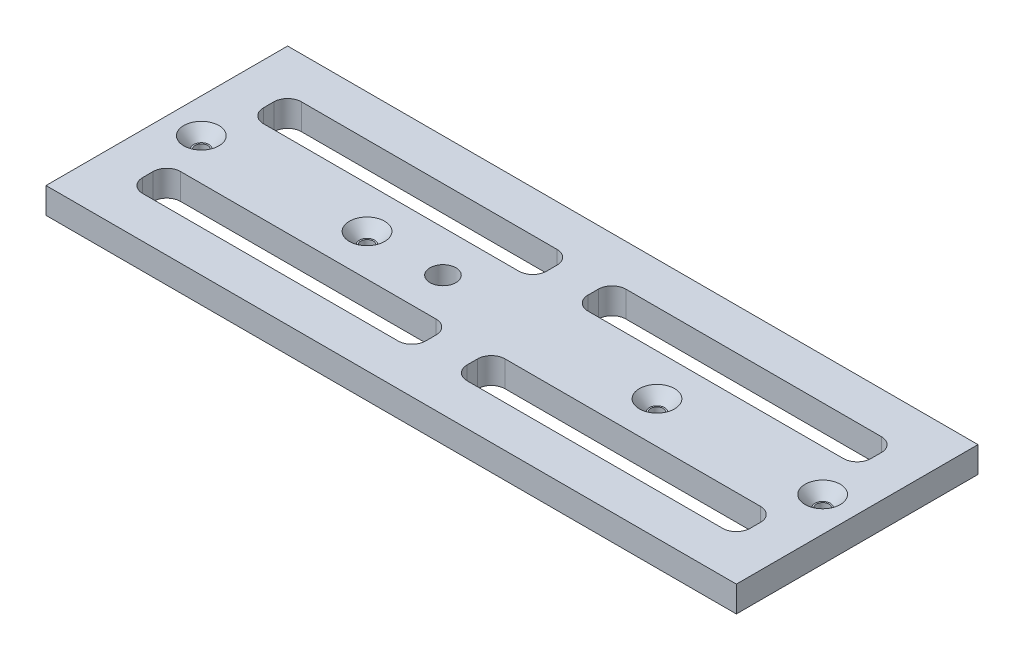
ISO-10303-21;
HEADER;
FILE_DESCRIPTION(('STEP AP214'),'2;1');
FILE_NAME('part.step','',(''),(''),'','','');
FILE_SCHEMA(('AUTOMOTIVE_DESIGN { 1 0 10303 214 1 1 1 1 }'));
ENDSEC;
DATA;
#1=APPLICATION_CONTEXT('core data for automotive mechanical design processes');
#2=APPLICATION_PROTOCOL_DEFINITION('international standard','automotive_design',2000,#1);
#3=PRODUCT_CONTEXT('',#1,'mechanical');
#4=PRODUCT('Part','Part','',(#3));
#5=PRODUCT_RELATED_PRODUCT_CATEGORY('part','',(#4));
#6=PRODUCT_DEFINITION_FORMATION('','',#4);
#7=PRODUCT_DEFINITION_CONTEXT('part definition',#1,'design');
#8=PRODUCT_DEFINITION('design','',#6,#7);
#9=PRODUCT_DEFINITION_SHAPE('','',#8);
#10=(LENGTH_UNIT() NAMED_UNIT(*) SI_UNIT(.MILLI.,.METRE.));
#11=(NAMED_UNIT(*) PLANE_ANGLE_UNIT() SI_UNIT($,.RADIAN.));
#12=(NAMED_UNIT(*) SI_UNIT($,.STERADIAN.) SOLID_ANGLE_UNIT());
#13=UNCERTAINTY_MEASURE_WITH_UNIT(LENGTH_MEASURE(1.E-05),#10,'distance_accuracy_value','');
#14=(GEOMETRIC_REPRESENTATION_CONTEXT(3) GLOBAL_UNCERTAINTY_ASSIGNED_CONTEXT((#13)) GLOBAL_UNIT_ASSIGNED_CONTEXT((#10,
#11,#12)) REPRESENTATION_CONTEXT('',''));
#15=CARTESIAN_POINT('',(0.,0.,0.));
#16=DIRECTION('',(0.,0.,1.));
#17=DIRECTION('',(1.,0.,0.));
#18=AXIS2_PLACEMENT_3D('',#15,#16,#17);
#19=CARTESIAN_POINT('',(-26.67,0.,0.));
#20=DIRECTION('',(0.,1.,0.));
#21=DIRECTION('',(0.,0.,1.));
#22=AXIS2_PLACEMENT_3D('',#19,#20,#21);
#23=CYLINDRICAL_SURFACE('',#22,1.143);
#24=CARTESIAN_POINT('',(-26.67,0.,0.));
#25=DIRECTION('',(0.,1.,0.));
#26=DIRECTION('',(0.,0.,1.));
#27=AXIS2_PLACEMENT_3D('',#24,#25,#26);
#28=CIRCLE('',#27,1.143);
#29=CARTESIAN_POINT('',(-26.67,0.,1.143));
#30=VERTEX_POINT('',#29);
#31=EDGE_CURVE('E523',#30,#30,#28,.T.);
#32=CARTESIAN_POINT('',(-26.67,2.6543,0.));
#33=DIRECTION('',(0.,1.,0.));
#34=DIRECTION('',(0.,0.,1.));
#35=AXIS2_PLACEMENT_3D('',#32,#33,#34);
#36=CIRCLE('',#35,1.143);
#37=CARTESIAN_POINT('',(-26.67,2.6543,1.143));
#38=VERTEX_POINT('',#37);
#39=EDGE_CURVE('E303',#38,#38,#36,.F.);
#40=CARTESIAN_POINT('',(-26.67,0.,1.143));
#41=CARTESIAN_POINT('',(-26.67,0.0276489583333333,1.143));
#42=CARTESIAN_POINT('',(-26.67,0.0552979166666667,1.143));
#43=CARTESIAN_POINT('',(-26.67,0.110595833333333,1.143));
#44=CARTESIAN_POINT('',(-26.67,0.138244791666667,1.143));
#45=CARTESIAN_POINT('',(-26.67,0.193542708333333,1.143));
#46=CARTESIAN_POINT('',(-26.67,0.221191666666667,1.143));
#47=CARTESIAN_POINT('',(-26.67,0.276489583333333,1.143));
#48=CARTESIAN_POINT('',(-26.67,0.304138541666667,1.143));
#49=CARTESIAN_POINT('',(-26.67,0.359436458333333,1.143));
#50=CARTESIAN_POINT('',(-26.67,0.387085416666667,1.143));
#51=CARTESIAN_POINT('',(-26.67,0.442383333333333,1.143));
#52=CARTESIAN_POINT('',(-26.67,0.470032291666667,1.143));
#53=CARTESIAN_POINT('',(-26.67,0.525330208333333,1.143));
#54=CARTESIAN_POINT('',(-26.67,0.552979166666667,1.143));
#55=CARTESIAN_POINT('',(-26.67,0.608277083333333,1.143));
#56=CARTESIAN_POINT('',(-26.67,0.635926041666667,1.143));
#57=CARTESIAN_POINT('',(-26.67,0.691223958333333,1.143));
#58=CARTESIAN_POINT('',(-26.67,0.718872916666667,1.143));
#59=CARTESIAN_POINT('',(-26.67,0.774170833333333,1.143));
#60=CARTESIAN_POINT('',(-26.67,0.801819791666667,1.143));
#61=CARTESIAN_POINT('',(-26.67,0.857117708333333,1.143));
#62=CARTESIAN_POINT('',(-26.67,0.884766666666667,1.143));
#63=CARTESIAN_POINT('',(-26.67,0.940064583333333,1.143));
#64=CARTESIAN_POINT('',(-26.67,0.967713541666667,1.143));
#65=CARTESIAN_POINT('',(-26.67,1.02301145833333,1.143));
#66=CARTESIAN_POINT('',(-26.67,1.05066041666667,1.143));
#67=CARTESIAN_POINT('',(-26.67,1.10595833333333,1.143));
#68=CARTESIAN_POINT('',(-26.67,1.13360729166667,1.143));
#69=CARTESIAN_POINT('',(-26.67,1.18890520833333,1.143));
#70=CARTESIAN_POINT('',(-26.67,1.21655416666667,1.143));
#71=CARTESIAN_POINT('',(-26.67,1.27185208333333,1.143));
#72=CARTESIAN_POINT('',(-26.67,1.29950104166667,1.143));
#73=CARTESIAN_POINT('',(-26.67,1.35479895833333,1.143));
#74=CARTESIAN_POINT('',(-26.67,1.38244791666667,1.143));
#75=CARTESIAN_POINT('',(-26.67,1.43774583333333,1.143));
#76=CARTESIAN_POINT('',(-26.67,1.46539479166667,1.143));
#77=CARTESIAN_POINT('',(-26.67,1.52069270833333,1.143));
#78=CARTESIAN_POINT('',(-26.67,1.54834166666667,1.143));
#79=CARTESIAN_POINT('',(-26.67,1.60363958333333,1.143));
#80=CARTESIAN_POINT('',(-26.67,1.63128854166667,1.143));
#81=CARTESIAN_POINT('',(-26.67,1.68658645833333,1.143));
#82=CARTESIAN_POINT('',(-26.67,1.71423541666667,1.143));
#83=CARTESIAN_POINT('',(-26.67,1.76953333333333,1.143));
#84=CARTESIAN_POINT('',(-26.67,1.79718229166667,1.143));
#85=CARTESIAN_POINT('',(-26.67,1.85248020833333,1.143));
#86=CARTESIAN_POINT('',(-26.67,1.88012916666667,1.143));
#87=CARTESIAN_POINT('',(-26.67,1.93542708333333,1.143));
#88=CARTESIAN_POINT('',(-26.67,1.96307604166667,1.143));
#89=CARTESIAN_POINT('',(-26.67,2.01837395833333,1.143));
#90=CARTESIAN_POINT('',(-26.67,2.04602291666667,1.143));
#91=CARTESIAN_POINT('',(-26.67,2.10132083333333,1.143));
#92=CARTESIAN_POINT('',(-26.67,2.12896979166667,1.143));
#93=CARTESIAN_POINT('',(-26.67,2.18426770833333,1.143));
#94=CARTESIAN_POINT('',(-26.67,2.21191666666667,1.143));
#95=CARTESIAN_POINT('',(-26.67,2.26721458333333,1.143));
#96=CARTESIAN_POINT('',(-26.67,2.29486354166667,1.143));
#97=CARTESIAN_POINT('',(-26.67,2.35016145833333,1.143));
#98=CARTESIAN_POINT('',(-26.67,2.37781041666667,1.143));
#99=CARTESIAN_POINT('',(-26.67,2.43310833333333,1.143));
#100=CARTESIAN_POINT('',(-26.67,2.46075729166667,1.143));
#101=CARTESIAN_POINT('',(-26.67,2.51605520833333,1.143));
#102=CARTESIAN_POINT('',(-26.67,2.54370416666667,1.143));
#103=CARTESIAN_POINT('',(-26.67,2.59900208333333,1.143));
#104=CARTESIAN_POINT('',(-26.67,2.62665104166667,1.143));
#105=CARTESIAN_POINT('',(-26.67,2.6543,1.143));
#106=B_SPLINE_CURVE_WITH_KNOTS('',3,(#40,#41,#42,#43,#44,#45,#46,#47,#48,#49,#50,#51,#52,#53,
#54,#55,#56,#57,#58,#59,#60,#61,#62,#63,#64,#65,#66,#67,#68,#69,#70,#71,#72,#73,#74,#75,#76,#77,
#78,#79,#80,#81,#82,#83,#84,#85,#86,#87,#88,#89,#90,#91,#92,#93,#94,#95,#96,#97,#98,#99,#100,
#101,#102,#103,#104,#105),.UNSPECIFIED.,.F.,.F.,(4,2,2,2,2,2,2,2,2,2,2,2,2,2,2,2,2,2,2,2,2,2,2,
2,2,2,2,2,2,2,2,2,4),(0.,0.082946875,0.16589375,0.248840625,0.3317875,0.414734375,0.49768125,
0.580628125,0.663575,0.746521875,0.82946875,0.912415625,0.9953625,1.078309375,1.16125625,
1.244203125,1.32715,1.410096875,1.49304375,1.575990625,1.6589375,1.741884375,1.82483125,
1.907778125,1.990725,2.073671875,2.15661875,2.239565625,2.3225125,2.405459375,2.48840625,
2.571353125,2.6543),.UNSPECIFIED.);
#107=EDGE_CURVE('BSEAM31',#30,#38,#106,.T.);
#108=ORIENTED_EDGE('',*,*,#31,.F.);
#109=ORIENTED_EDGE('',*,*,#39,.F.);
#110=ORIENTED_EDGE('',*,*,#107,.T.);
#111=ORIENTED_EDGE('',*,*,#107,.F.);
#112=EDGE_LOOP('',(#108,#110,#109,#111));
#113=FACE_BOUND('',#112,.T.);
#114=ADVANCED_FACE('F31',(#113),#23,.F.);
#115=CARTESIAN_POINT('',(-57.15,0.,0.));
#116=DIRECTION('',(0.,1.,0.));
#117=DIRECTION('',(0.,0.,1.));
#118=AXIS2_PLACEMENT_3D('',#115,#116,#117);
#119=CYLINDRICAL_SURFACE('',#118,1.143);
#120=CARTESIAN_POINT('',(-57.15,0.,0.));
#121=DIRECTION('',(0.,1.,0.));
#122=DIRECTION('',(0.,0.,1.));
#123=AXIS2_PLACEMENT_3D('',#120,#121,#122);
#124=CIRCLE('',#123,1.143);
#125=CARTESIAN_POINT('',(-57.15,0.,1.143));
#126=VERTEX_POINT('',#125);
#127=EDGE_CURVE('E526',#126,#126,#124,.T.);
#128=CARTESIAN_POINT('',(-57.15,2.6543,0.));
#129=DIRECTION('',(0.,1.,0.));
#130=DIRECTION('',(0.,0.,1.));
#131=AXIS2_PLACEMENT_3D('',#128,#129,#130);
#132=CIRCLE('',#131,1.143);
#133=CARTESIAN_POINT('',(-57.15,2.6543,1.143));
#134=VERTEX_POINT('',#133);
#135=EDGE_CURVE('E298',#134,#134,#132,.F.);
#136=CARTESIAN_POINT('',(-57.15,0.,1.143));
#137=CARTESIAN_POINT('',(-57.15,0.0276489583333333,1.143));
#138=CARTESIAN_POINT('',(-57.15,0.0552979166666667,1.143));
#139=CARTESIAN_POINT('',(-57.15,0.110595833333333,1.143));
#140=CARTESIAN_POINT('',(-57.15,0.138244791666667,1.143));
#141=CARTESIAN_POINT('',(-57.15,0.193542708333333,1.143));
#142=CARTESIAN_POINT('',(-57.15,0.221191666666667,1.143));
#143=CARTESIAN_POINT('',(-57.15,0.276489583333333,1.143));
#144=CARTESIAN_POINT('',(-57.15,0.304138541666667,1.143));
#145=CARTESIAN_POINT('',(-57.15,0.359436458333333,1.143));
#146=CARTESIAN_POINT('',(-57.15,0.387085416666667,1.143));
#147=CARTESIAN_POINT('',(-57.15,0.442383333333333,1.143));
#148=CARTESIAN_POINT('',(-57.15,0.470032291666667,1.143));
#149=CARTESIAN_POINT('',(-57.15,0.525330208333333,1.143));
#150=CARTESIAN_POINT('',(-57.15,0.552979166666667,1.143));
#151=CARTESIAN_POINT('',(-57.15,0.608277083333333,1.143));
#152=CARTESIAN_POINT('',(-57.15,0.635926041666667,1.143));
#153=CARTESIAN_POINT('',(-57.15,0.691223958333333,1.143));
#154=CARTESIAN_POINT('',(-57.15,0.718872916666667,1.143));
#155=CARTESIAN_POINT('',(-57.15,0.774170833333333,1.143));
#156=CARTESIAN_POINT('',(-57.15,0.801819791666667,1.143));
#157=CARTESIAN_POINT('',(-57.15,0.857117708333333,1.143));
#158=CARTESIAN_POINT('',(-57.15,0.884766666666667,1.143));
#159=CARTESIAN_POINT('',(-57.15,0.940064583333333,1.143));
#160=CARTESIAN_POINT('',(-57.15,0.967713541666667,1.143));
#161=CARTESIAN_POINT('',(-57.15,1.02301145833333,1.143));
#162=CARTESIAN_POINT('',(-57.15,1.05066041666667,1.143));
#163=CARTESIAN_POINT('',(-57.15,1.10595833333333,1.143));
#164=CARTESIAN_POINT('',(-57.15,1.13360729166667,1.143));
#165=CARTESIAN_POINT('',(-57.15,1.18890520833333,1.143));
#166=CARTESIAN_POINT('',(-57.15,1.21655416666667,1.143));
#167=CARTESIAN_POINT('',(-57.15,1.27185208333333,1.143));
#168=CARTESIAN_POINT('',(-57.15,1.29950104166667,1.143));
#169=CARTESIAN_POINT('',(-57.15,1.35479895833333,1.143));
#170=CARTESIAN_POINT('',(-57.15,1.38244791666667,1.143));
#171=CARTESIAN_POINT('',(-57.15,1.43774583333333,1.143));
#172=CARTESIAN_POINT('',(-57.15,1.46539479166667,1.143));
#173=CARTESIAN_POINT('',(-57.15,1.52069270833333,1.143));
#174=CARTESIAN_POINT('',(-57.15,1.54834166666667,1.143));
#175=CARTESIAN_POINT('',(-57.15,1.60363958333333,1.143));
#176=CARTESIAN_POINT('',(-57.15,1.63128854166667,1.143));
#177=CARTESIAN_POINT('',(-57.15,1.68658645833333,1.143));
#178=CARTESIAN_POINT('',(-57.15,1.71423541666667,1.143));
#179=CARTESIAN_POINT('',(-57.15,1.76953333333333,1.143));
#180=CARTESIAN_POINT('',(-57.15,1.79718229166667,1.143));
#181=CARTESIAN_POINT('',(-57.15,1.85248020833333,1.143));
#182=CARTESIAN_POINT('',(-57.15,1.88012916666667,1.143));
#183=CARTESIAN_POINT('',(-57.15,1.93542708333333,1.143));
#184=CARTESIAN_POINT('',(-57.15,1.96307604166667,1.143));
#185=CARTESIAN_POINT('',(-57.15,2.01837395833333,1.143));
#186=CARTESIAN_POINT('',(-57.15,2.04602291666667,1.143));
#187=CARTESIAN_POINT('',(-57.15,2.10132083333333,1.143));
#188=CARTESIAN_POINT('',(-57.15,2.12896979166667,1.143));
#189=CARTESIAN_POINT('',(-57.15,2.18426770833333,1.143));
#190=CARTESIAN_POINT('',(-57.15,2.21191666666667,1.143));
#191=CARTESIAN_POINT('',(-57.15,2.26721458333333,1.143));
#192=CARTESIAN_POINT('',(-57.15,2.29486354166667,1.143));
#193=CARTESIAN_POINT('',(-57.15,2.35016145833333,1.143));
#194=CARTESIAN_POINT('',(-57.15,2.37781041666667,1.143));
#195=CARTESIAN_POINT('',(-57.15,2.43310833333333,1.143));
#196=CARTESIAN_POINT('',(-57.15,2.46075729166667,1.143));
#197=CARTESIAN_POINT('',(-57.15,2.51605520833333,1.143));
#198=CARTESIAN_POINT('',(-57.15,2.54370416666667,1.143));
#199=CARTESIAN_POINT('',(-57.15,2.59900208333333,1.143));
#200=CARTESIAN_POINT('',(-57.15,2.62665104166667,1.143));
#201=CARTESIAN_POINT('',(-57.15,2.6543,1.143));
#202=B_SPLINE_CURVE_WITH_KNOTS('',3,(#136,#137,#138,#139,#140,#141,#142,#143,#144,#145,#146,
#147,#148,#149,#150,#151,#152,#153,#154,#155,#156,#157,#158,#159,#160,#161,#162,#163,#164,#165,
#166,#167,#168,#169,#170,#171,#172,#173,#174,#175,#176,#177,#178,#179,#180,#181,#182,#183,#184,
#185,#186,#187,#188,#189,#190,#191,#192,#193,#194,#195,#196,#197,#198,#199,#200,#201),
.UNSPECIFIED.,.F.,.F.,(4,2,2,2,2,2,2,2,2,2,2,2,2,2,2,2,2,2,2,2,2,2,2,2,2,2,2,2,2,2,2,2,4),(0.,
0.082946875,0.16589375,0.248840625,0.3317875,0.414734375,0.49768125,0.580628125,0.663575,
0.746521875,0.82946875,0.912415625,0.9953625,1.078309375,1.16125625,1.244203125,1.32715,
1.410096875,1.49304375,1.575990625,1.6589375,1.741884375,1.82483125,1.907778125,1.990725,
2.073671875,2.15661875,2.239565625,2.3225125,2.405459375,2.48840625,2.571353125,2.6543),.UNSPECIFIED.);
#203=EDGE_CURVE('BSEAM556',#126,#134,#202,.T.);
#204=ORIENTED_EDGE('',*,*,#127,.F.);
#205=ORIENTED_EDGE('',*,*,#135,.F.);
#206=ORIENTED_EDGE('',*,*,#203,.T.);
#207=ORIENTED_EDGE('',*,*,#203,.F.);
#208=EDGE_LOOP('',(#204,#206,#205,#207));
#209=FACE_BOUND('',#208,.T.);
#210=ADVANCED_FACE('F556',(#209),#119,.F.);
#211=CARTESIAN_POINT('',(63.5,4.7625,22.225));
#212=DIRECTION('',(-1.,0.,0.));
#213=DIRECTION('',(0.,0.,1.));
#214=AXIS2_PLACEMENT_3D('',#211,#212,#213);
#215=PLANE('',#214);
#216=DIRECTION('',(0.,0.,-1.));
#217=VECTOR('',#216,1.);
#218=CARTESIAN_POINT('',(63.5,0.,22.225));
#219=LINE('',#218,#217);
#220=CARTESIAN_POINT('',(63.5,0.,22.225));
#221=VERTEX_POINT('',#220);
#222=CARTESIAN_POINT('',(63.5,0.,-22.225));
#223=VERTEX_POINT('',#222);
#224=EDGE_CURVE('E289',#221,#223,#219,.T.);
#225=ORIENTED_EDGE('',*,*,#224,.T.);
#226=DIRECTION('',(0.,-1.,0.));
#227=VECTOR('',#226,1.);
#228=CARTESIAN_POINT('',(63.5,4.7625,-22.225));
#229=LINE('',#228,#227);
#230=CARTESIAN_POINT('',(63.5,4.7625,-22.225));
#231=VERTEX_POINT('',#230);
#232=EDGE_CURVE('E269',#231,#223,#229,.T.);
#233=ORIENTED_EDGE('',*,*,#232,.F.);
#234=DIRECTION('',(0.,0.,-1.));
#235=VECTOR('',#234,1.);
#236=CARTESIAN_POINT('',(63.5,4.7625,22.225));
#237=LINE('',#236,#235);
#238=CARTESIAN_POINT('',(63.5,4.7625,22.225));
#239=VERTEX_POINT('',#238);
#240=EDGE_CURVE('E276',#239,#231,#237,.T.);
#241=ORIENTED_EDGE('',*,*,#240,.F.);
#242=DIRECTION('',(0.,-1.,0.));
#243=VECTOR('',#242,1.);
#244=CARTESIAN_POINT('',(63.5,4.7625,22.225));
#245=LINE('',#244,#243);
#246=EDGE_CURVE('E531',#239,#221,#245,.T.);
#247=ORIENTED_EDGE('',*,*,#246,.T.);
#248=EDGE_LOOP('',(#225,#233,#241,#247));
#249=FACE_BOUND('',#248,.T.);
#250=ADVANCED_FACE('F287',(#249),#215,.F.);
#251=CARTESIAN_POINT('',(-63.5,4.7625,-22.225));
#252=DIRECTION('',(0.,0.,1.));
#253=DIRECTION('',(1.,0.,0.));
#254=AXIS2_PLACEMENT_3D('',#251,#252,#253);
#255=PLANE('',#254);
#256=DIRECTION('',(-1.,0.,0.));
#257=VECTOR('',#256,1.);
#258=CARTESIAN_POINT('',(-63.5,0.,-22.225));
#259=LINE('',#258,#257);
#260=CARTESIAN_POINT('',(-63.5,0.,-22.225));
#261=VERTEX_POINT('',#260);
#262=EDGE_CURVE('E533',#223,#261,#259,.T.);
#263=ORIENTED_EDGE('',*,*,#262,.T.);
#264=DIRECTION('',(0.,-1.,0.));
#265=VECTOR('',#264,1.);
#266=CARTESIAN_POINT('',(-63.5,4.7625,-22.225));
#267=LINE('',#266,#265);
#268=CARTESIAN_POINT('',(-63.5,4.7625,-22.225));
#269=VERTEX_POINT('',#268);
#270=EDGE_CURVE('E272',#269,#261,#267,.T.);
#271=ORIENTED_EDGE('',*,*,#270,.F.);
#272=DIRECTION('',(-1.,0.,0.));
#273=VECTOR('',#272,1.);
#274=CARTESIAN_POINT('',(-63.5,4.7625,-22.225));
#275=LINE('',#274,#273);
#276=EDGE_CURVE('E265',#231,#269,#275,.T.);
#277=ORIENTED_EDGE('',*,*,#276,.F.);
#278=ORIENTED_EDGE('',*,*,#232,.T.);
#279=EDGE_LOOP('',(#263,#271,#277,#278));
#280=FACE_BOUND('',#279,.T.);
#281=ADVANCED_FACE('F267',(#280),#255,.F.);
#282=CARTESIAN_POINT('',(-63.5,4.7625,22.225));
#283=DIRECTION('',(1.,0.,0.));
#284=DIRECTION('',(0.,0.,-1.));
#285=AXIS2_PLACEMENT_3D('',#282,#283,#284);
#286=PLANE('',#285);
#287=DIRECTION('',(0.,0.,1.));
#288=VECTOR('',#287,1.);
#289=CARTESIAN_POINT('',(-63.5,0.,22.225));
#290=LINE('',#289,#288);
#291=CARTESIAN_POINT('',(-63.5,0.,22.225));
#292=VERTEX_POINT('',#291);
#293=EDGE_CURVE('E535',#261,#292,#290,.T.);
#294=ORIENTED_EDGE('',*,*,#293,.T.);
#295=DIRECTION('',(0.,-1.,0.));
#296=VECTOR('',#295,1.);
#297=CARTESIAN_POINT('',(-63.5,4.7625,22.225));
#298=LINE('',#297,#296);
#299=CARTESIAN_POINT('',(-63.5,4.7625,22.225));
#300=VERTEX_POINT('',#299);
#301=EDGE_CURVE('E294',#300,#292,#298,.T.);
#302=ORIENTED_EDGE('',*,*,#301,.F.);
#303=DIRECTION('',(0.,0.,1.));
#304=VECTOR('',#303,1.);
#305=CARTESIAN_POINT('',(-63.5,4.7625,22.225));
#306=LINE('',#305,#304);
#307=EDGE_CURVE('E275',#269,#300,#306,.T.);
#308=ORIENTED_EDGE('',*,*,#307,.F.);
#309=ORIENTED_EDGE('',*,*,#270,.T.);
#310=EDGE_LOOP('',(#294,#302,#308,#309));
#311=FACE_BOUND('',#310,.T.);
#312=ADVANCED_FACE('F546',(#311),#286,.F.);
#313=CARTESIAN_POINT('',(-63.5,4.7625,22.225));
#314=DIRECTION('',(0.,0.,-1.));
#315=DIRECTION('',(-1.,0.,0.));
#316=AXIS2_PLACEMENT_3D('',#313,#314,#315);
#317=PLANE('',#316);
#318=DIRECTION('',(1.,0.,0.));
#319=VECTOR('',#318,1.);
#320=CARTESIAN_POINT('',(-63.5,0.,22.225));
#321=LINE('',#320,#319);
#322=EDGE_CURVE('E285',#292,#221,#321,.T.);
#323=ORIENTED_EDGE('',*,*,#322,.T.);
#324=ORIENTED_EDGE('',*,*,#246,.F.);
#325=DIRECTION('',(1.,0.,0.));
#326=VECTOR('',#325,1.);
#327=CARTESIAN_POINT('',(-63.5,4.7625,22.225));
#328=LINE('',#327,#326);
#329=EDGE_CURVE('E281',#300,#239,#328,.T.);
#330=ORIENTED_EDGE('',*,*,#329,.F.);
#331=ORIENTED_EDGE('',*,*,#301,.T.);
#332=EDGE_LOOP('',(#323,#324,#330,#331));
#333=FACE_BOUND('',#332,.T.);
#334=ADVANCED_FACE('F542',(#333),#317,.F.);
#335=CARTESIAN_POINT('',(63.5,4.7625,-22.225));
#336=DIRECTION('',(0.,-1.,0.));
#337=DIRECTION('',(0.,0.,-1.));
#338=AXIS2_PLACEMENT_3D('',#335,#336,#337);
#339=PLANE('',#338);
#340=DIRECTION('',(0.,0.,1.));
#341=VECTOR('',#340,1.);
#342=CARTESIAN_POINT('',(3.81,4.7625,-14.605));
#343=LINE('',#342,#341);
#344=CARTESIAN_POINT('',(3.81,4.7625,-12.065));
#345=VERTEX_POINT('',#344);
#346=CARTESIAN_POINT('',(3.81,4.7625,-10.16));
#347=VERTEX_POINT('',#346);
#348=EDGE_CURVE('E1167',#345,#347,#343,.T.);
#349=ORIENTED_EDGE('',*,*,#348,.F.);
#350=CARTESIAN_POINT('',(6.35,4.7625,-12.065));
#351=DIRECTION('',(0.,-1.,0.));
#352=DIRECTION('',(0.,0.,-1.));
#353=AXIS2_PLACEMENT_3D('',#350,#351,#352);
#354=CIRCLE('',#353,2.54);
#355=CARTESIAN_POINT('',(6.35000000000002,4.7625,-14.605));
#356=VERTEX_POINT('',#355);
#357=EDGE_CURVE('E414',#345,#356,#354,.T.);
#358=ORIENTED_EDGE('',*,*,#357,.T.);
#359=DIRECTION('',(-1.,0.,0.));
#360=VECTOR('',#359,1.);
#361=CARTESIAN_POINT('',(55.88,4.7625,-14.605));
#362=LINE('',#361,#360);
#363=CARTESIAN_POINT('',(53.34,4.7625,-14.605));
#364=VERTEX_POINT('',#363);
#365=EDGE_CURVE('E1164',#364,#356,#362,.T.);
#366=ORIENTED_EDGE('',*,*,#365,.F.);
#367=CARTESIAN_POINT('',(53.34,4.7625,-12.065));
#368=DIRECTION('',(0.,-1.,0.));
#369=DIRECTION('',(0.,0.,-1.));
#370=AXIS2_PLACEMENT_3D('',#367,#368,#369);
#371=CIRCLE('',#370,2.54);
#372=CARTESIAN_POINT('',(55.88,4.7625,-12.065));
#373=VERTEX_POINT('',#372);
#374=EDGE_CURVE('E402',#364,#373,#371,.T.);
#375=ORIENTED_EDGE('',*,*,#374,.T.);
#376=DIRECTION('',(0.,0.,-1.));
#377=VECTOR('',#376,1.);
#378=CARTESIAN_POINT('',(55.88,4.7625,-14.605));
#379=LINE('',#378,#377);
#380=CARTESIAN_POINT('',(55.88,4.7625,-10.16));
#381=VERTEX_POINT('',#380);
#382=EDGE_CURVE('E1140',#381,#373,#379,.T.);
#383=ORIENTED_EDGE('',*,*,#382,.F.);
#384=CARTESIAN_POINT('',(53.34,4.7625,-10.16));
#385=DIRECTION('',(0.,-1.,0.));
#386=DIRECTION('',(0.,0.,-1.));
#387=AXIS2_PLACEMENT_3D('',#384,#385,#386);
#388=CIRCLE('',#387,2.54);
#389=CARTESIAN_POINT('',(53.34,4.7625,-7.62000000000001));
#390=VERTEX_POINT('',#389);
#391=EDGE_CURVE('E398',#381,#390,#388,.T.);
#392=ORIENTED_EDGE('',*,*,#391,.T.);
#393=DIRECTION('',(1.,0.,0.));
#394=VECTOR('',#393,1.);
#395=CARTESIAN_POINT('',(55.88,4.7625,-7.62000000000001));
#396=LINE('',#395,#394);
#397=CARTESIAN_POINT('',(6.35,4.7625,-7.62));
#398=VERTEX_POINT('',#397);
#399=EDGE_CURVE('E1169',#398,#390,#396,.T.);
#400=ORIENTED_EDGE('',*,*,#399,.F.);
#401=CARTESIAN_POINT('',(6.35,4.7625,-10.16));
#402=DIRECTION('',(0.,-1.,0.));
#403=DIRECTION('',(0.,0.,-1.));
#404=AXIS2_PLACEMENT_3D('',#401,#402,#403);
#405=CIRCLE('',#404,2.54);
#406=EDGE_CURVE('E410',#398,#347,#405,.T.);
#407=ORIENTED_EDGE('',*,*,#406,.T.);
#408=EDGE_LOOP('',(#349,#358,#366,#375,#383,#392,#400,#407));
#409=FACE_BOUND('',#408,.T.);
#410=DIRECTION('',(-1.,0.,0.));
#411=VECTOR('',#410,1.);
#412=CARTESIAN_POINT('',(55.88,4.7625,7.62000000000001));
#413=LINE('',#412,#411);
#414=CARTESIAN_POINT('',(53.34,4.7625,7.62000000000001));
#415=VERTEX_POINT('',#414);
#416=CARTESIAN_POINT('',(6.35000000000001,4.7625,7.62));
#417=VERTEX_POINT('',#416);
#418=EDGE_CURVE('E1146',#415,#417,#413,.T.);
#419=ORIENTED_EDGE('',*,*,#418,.F.);
#420=CARTESIAN_POINT('',(53.34,4.7625,10.16));
#421=DIRECTION('',(0.,-1.,0.));
#422=DIRECTION('',(0.,0.,-1.));
#423=AXIS2_PLACEMENT_3D('',#420,#421,#422);
#424=CIRCLE('',#423,2.54);
#425=CARTESIAN_POINT('',(55.88,4.7625,10.16));
#426=VERTEX_POINT('',#425);
#427=EDGE_CURVE('E406',#415,#426,#424,.T.);
#428=ORIENTED_EDGE('',*,*,#427,.T.);
#429=DIRECTION('',(0.,0.,-1.));
#430=VECTOR('',#429,1.);
#431=CARTESIAN_POINT('',(55.88,4.7625,14.605));
#432=LINE('',#431,#430);
#433=CARTESIAN_POINT('',(55.88,4.7625,12.065));
#434=VERTEX_POINT('',#433);
#435=EDGE_CURVE('E1144',#434,#426,#432,.T.);
#436=ORIENTED_EDGE('',*,*,#435,.F.);
#437=CARTESIAN_POINT('',(53.34,4.7625,12.065));
#438=DIRECTION('',(0.,-1.,0.));
#439=DIRECTION('',(0.,0.,-1.));
#440=AXIS2_PLACEMENT_3D('',#437,#438,#439);
#441=CIRCLE('',#440,2.54);
#442=CARTESIAN_POINT('',(53.34,4.7625,14.605));
#443=VERTEX_POINT('',#442);
#444=EDGE_CURVE('E394',#434,#443,#441,.T.);
#445=ORIENTED_EDGE('',*,*,#444,.T.);
#446=DIRECTION('',(1.,0.,0.));
#447=VECTOR('',#446,1.);
#448=CARTESIAN_POINT('',(55.88,4.7625,14.605));
#449=LINE('',#448,#447);
#450=CARTESIAN_POINT('',(6.35000000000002,4.7625,14.605));
#451=VERTEX_POINT('',#450);
#452=EDGE_CURVE('E634',#451,#443,#449,.T.);
#453=ORIENTED_EDGE('',*,*,#452,.F.);
#454=CARTESIAN_POINT('',(6.35,4.7625,12.065));
#455=DIRECTION('',(0.,-1.,0.));
#456=DIRECTION('',(0.,0.,-1.));
#457=AXIS2_PLACEMENT_3D('',#454,#455,#456);
#458=CIRCLE('',#457,2.54);
#459=CARTESIAN_POINT('',(3.81,4.7625,12.065));
#460=VERTEX_POINT('',#459);
#461=EDGE_CURVE('E422',#451,#460,#458,.T.);
#462=ORIENTED_EDGE('',*,*,#461,.T.);
#463=DIRECTION('',(0.,0.,1.));
#464=VECTOR('',#463,1.);
#465=CARTESIAN_POINT('',(3.81,4.7625,14.605));
#466=LINE('',#465,#464);
#467=CARTESIAN_POINT('',(3.81,4.7625,10.16));
#468=VERTEX_POINT('',#467);
#469=EDGE_CURVE('E1138',#468,#460,#466,.T.);
#470=ORIENTED_EDGE('',*,*,#469,.F.);
#471=CARTESIAN_POINT('',(6.35,4.7625,10.16));
#472=DIRECTION('',(0.,-1.,0.));
#473=DIRECTION('',(0.,0.,-1.));
#474=AXIS2_PLACEMENT_3D('',#471,#472,#473);
#475=CIRCLE('',#474,2.54);
#476=EDGE_CURVE('E418',#468,#417,#475,.T.);
#477=ORIENTED_EDGE('',*,*,#476,.T.);
#478=EDGE_LOOP('',(#419,#428,#436,#445,#453,#462,#470,#477));
#479=FACE_BOUND('',#478,.T.);
#480=DIRECTION('',(0.,0.,-1.));
#481=VECTOR('',#480,1.);
#482=CARTESIAN_POINT('',(-3.81,4.7625,14.605));
#483=LINE('',#482,#481);
#484=CARTESIAN_POINT('',(-3.81,4.7625,12.065));
#485=VERTEX_POINT('',#484);
#486=CARTESIAN_POINT('',(-3.81,4.7625,10.16));
#487=VERTEX_POINT('',#486);
#488=EDGE_CURVE('E616',#485,#487,#483,.T.);
#489=ORIENTED_EDGE('',*,*,#488,.F.);
#490=CARTESIAN_POINT('',(-6.35,4.7625,12.065));
#491=DIRECTION('',(0.,-1.,0.));
#492=DIRECTION('',(0.,0.,-1.));
#493=AXIS2_PLACEMENT_3D('',#490,#491,#492);
#494=CIRCLE('',#493,2.54);
#495=CARTESIAN_POINT('',(-6.35000000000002,4.7625,14.605));
#496=VERTEX_POINT('',#495);
#497=EDGE_CURVE('E430',#485,#496,#494,.T.);
#498=ORIENTED_EDGE('',*,*,#497,.T.);
#499=DIRECTION('',(1.,0.,0.));
#500=VECTOR('',#499,1.);
#501=CARTESIAN_POINT('',(-55.88,4.7625,14.605));
#502=LINE('',#501,#500);
#503=CARTESIAN_POINT('',(-53.34,4.7625,14.605));
#504=VERTEX_POINT('',#503);
#505=EDGE_CURVE('E609',#504,#496,#502,.T.);
#506=ORIENTED_EDGE('',*,*,#505,.F.);
#507=CARTESIAN_POINT('',(-53.34,4.7625,12.065));
#508=DIRECTION('',(0.,-1.,0.));
#509=DIRECTION('',(0.,0.,-1.));
#510=AXIS2_PLACEMENT_3D('',#507,#508,#509);
#511=CIRCLE('',#510,2.54);
#512=CARTESIAN_POINT('',(-55.88,4.7625,12.065));
#513=VERTEX_POINT('',#512);
#514=EDGE_CURVE('E426',#504,#513,#511,.T.);
#515=ORIENTED_EDGE('',*,*,#514,.T.);
#516=DIRECTION('',(0.,0.,1.));
#517=VECTOR('',#516,1.);
#518=CARTESIAN_POINT('',(-55.88,4.7625,14.605));
#519=LINE('',#518,#517);
#520=CARTESIAN_POINT('',(-55.88,4.7625,10.16));
#521=VERTEX_POINT('',#520);
#522=EDGE_CURVE('E483',#521,#513,#519,.T.);
#523=ORIENTED_EDGE('',*,*,#522,.F.);
#524=CARTESIAN_POINT('',(-53.34,4.7625,10.16));
#525=DIRECTION('',(0.,-1.,0.));
#526=DIRECTION('',(0.,0.,-1.));
#527=AXIS2_PLACEMENT_3D('',#524,#525,#526);
#528=CIRCLE('',#527,2.54);
#529=CARTESIAN_POINT('',(-53.34,4.7625,7.62));
#530=VERTEX_POINT('',#529);
#531=EDGE_CURVE('E438',#521,#530,#528,.T.);
#532=ORIENTED_EDGE('',*,*,#531,.T.);
#533=DIRECTION('',(-1.,0.,0.));
#534=VECTOR('',#533,1.);
#535=CARTESIAN_POINT('',(-55.88,4.7625,7.62));
#536=LINE('',#535,#534);
#537=CARTESIAN_POINT('',(-6.35000000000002,4.7625,7.62));
#538=VERTEX_POINT('',#537);
#539=EDGE_CURVE('E619',#538,#530,#536,.T.);
#540=ORIENTED_EDGE('',*,*,#539,.F.);
#541=CARTESIAN_POINT('',(-6.35,4.7625,10.16));
#542=DIRECTION('',(0.,-1.,0.));
#543=DIRECTION('',(0.,0.,-1.));
#544=AXIS2_PLACEMENT_3D('',#541,#542,#543);
#545=CIRCLE('',#544,2.54);
#546=EDGE_CURVE('E434',#538,#487,#545,.T.);
#547=ORIENTED_EDGE('',*,*,#546,.T.);
#548=EDGE_LOOP('',(#489,#498,#506,#515,#523,#532,#540,#547));
#549=FACE_BOUND('',#548,.T.);
#550=DIRECTION('',(1.,0.,0.));
#551=VECTOR('',#550,1.);
#552=CARTESIAN_POINT('',(-55.88,4.7625,-7.62));
#553=LINE('',#552,#551);
#554=CARTESIAN_POINT('',(-53.34,4.7625,-7.62));
#555=VERTEX_POINT('',#554);
#556=CARTESIAN_POINT('',(-6.35000000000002,4.7625,-7.62));
#557=VERTEX_POINT('',#556);
#558=EDGE_CURVE('E490',#555,#557,#553,.T.);
#559=ORIENTED_EDGE('',*,*,#558,.F.);
#560=CARTESIAN_POINT('',(-53.34,4.7625,-10.16));
#561=DIRECTION('',(0.,-1.,0.));
#562=DIRECTION('',(0.,0.,-1.));
#563=AXIS2_PLACEMENT_3D('',#560,#561,#562);
#564=CIRCLE('',#563,2.54);
#565=CARTESIAN_POINT('',(-55.88,4.7625,-10.16));
#566=VERTEX_POINT('',#565);
#567=EDGE_CURVE('E442',#555,#566,#564,.T.);
#568=ORIENTED_EDGE('',*,*,#567,.T.);
#569=DIRECTION('',(0.,0.,1.));
#570=VECTOR('',#569,1.);
#571=CARTESIAN_POINT('',(-55.88,4.7625,-14.605));
#572=LINE('',#571,#570);
#573=CARTESIAN_POINT('',(-55.88,4.7625,-12.065));
#574=VERTEX_POINT('',#573);
#575=EDGE_CURVE('E459',#574,#566,#572,.T.);
#576=ORIENTED_EDGE('',*,*,#575,.F.);
#577=CARTESIAN_POINT('',(-53.34,4.7625,-12.065));
#578=DIRECTION('',(0.,-1.,0.));
#579=DIRECTION('',(0.,0.,-1.));
#580=AXIS2_PLACEMENT_3D('',#577,#578,#579);
#581=CIRCLE('',#580,2.54);
#582=CARTESIAN_POINT('',(-53.34,4.7625,-14.605));
#583=VERTEX_POINT('',#582);
#584=EDGE_CURVE('E39',#574,#583,#581,.T.);
#585=ORIENTED_EDGE('',*,*,#584,.T.);
#586=DIRECTION('',(-1.,0.,0.));
#587=VECTOR('',#586,1.);
#588=CARTESIAN_POINT('',(-55.88,4.7625,-14.605));
#589=LINE('',#588,#587);
#590=CARTESIAN_POINT('',(-6.35000000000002,4.7625,-14.605));
#591=VERTEX_POINT('',#590);
#592=EDGE_CURVE('E457',#591,#583,#589,.T.);
#593=ORIENTED_EDGE('',*,*,#592,.F.);
#594=CARTESIAN_POINT('',(-6.35,4.7625,-12.065));
#595=DIRECTION('',(0.,-1.,0.));
#596=DIRECTION('',(0.,0.,-1.));
#597=AXIS2_PLACEMENT_3D('',#594,#595,#596);
#598=CIRCLE('',#597,2.54);
#599=CARTESIAN_POINT('',(-3.81,4.7625,-12.065));
#600=VERTEX_POINT('',#599);
#601=EDGE_CURVE('E450',#591,#600,#598,.T.);
#602=ORIENTED_EDGE('',*,*,#601,.T.);
#603=DIRECTION('',(0.,0.,-1.));
#604=VECTOR('',#603,1.);
#605=CARTESIAN_POINT('',(-3.81,4.7625,-14.605));
#606=LINE('',#605,#604);
#607=CARTESIAN_POINT('',(-3.81,4.7625,-10.16));
#608=VERTEX_POINT('',#607);
#609=EDGE_CURVE('E465',#608,#600,#606,.T.);
#610=ORIENTED_EDGE('',*,*,#609,.F.);
#611=CARTESIAN_POINT('',(-6.35,4.7625,-10.16));
#612=DIRECTION('',(0.,-1.,0.));
#613=DIRECTION('',(0.,0.,-1.));
#614=AXIS2_PLACEMENT_3D('',#611,#612,#613);
#615=CIRCLE('',#614,2.54);
#616=EDGE_CURVE('E446',#608,#557,#615,.T.);
#617=ORIENTED_EDGE('',*,*,#616,.T.);
#618=EDGE_LOOP('',(#559,#568,#576,#585,#593,#602,#610,#617));
#619=FACE_BOUND('',#618,.T.);
#620=CARTESIAN_POINT('',(-12.7,4.7625,0.));
#621=DIRECTION('',(0.,1.,0.));
#622=DIRECTION('',(0.,0.,1.));
#623=AXIS2_PLACEMENT_3D('',#620,#621,#622);
#624=CIRCLE('',#623,2.38125);
#625=CARTESIAN_POINT('',(-12.7,4.7625,2.38125));
#626=VERTEX_POINT('',#625);
#627=EDGE_CURVE('E488',#626,#626,#624,.T.);
#628=ORIENTED_EDGE('',*,*,#627,.F.);
#629=EDGE_LOOP('',(#628));
#630=FACE_BOUND('',#629,.T.);
#631=CARTESIAN_POINT('',(57.15,4.7625,0.));
#632=DIRECTION('',(0.,1.,0.));
#633=DIRECTION('',(0.,0.,-1.));
#634=AXIS2_PLACEMENT_3D('',#631,#632,#633);
#635=CIRCLE('',#634,3.2385);
#636=CARTESIAN_POINT('',(57.15,4.7625,-3.2385));
#637=VERTEX_POINT('',#636);
#638=EDGE_CURVE('E499',#637,#637,#635,.T.);
#639=ORIENTED_EDGE('',*,*,#638,.F.);
#640=EDGE_LOOP('',(#639));
#641=FACE_BOUND('',#640,.T.);
#642=CARTESIAN_POINT('',(26.67,4.7625,0.));
#643=DIRECTION('',(0.,1.,0.));
#644=DIRECTION('',(0.,0.,-1.));
#645=AXIS2_PLACEMENT_3D('',#642,#643,#644);
#646=CIRCLE('',#645,3.2385);
#647=CARTESIAN_POINT('',(26.67,4.7625,-3.2385));
#648=VERTEX_POINT('',#647);
#649=EDGE_CURVE('E315',#648,#648,#646,.T.);
#650=ORIENTED_EDGE('',*,*,#649,.F.);
#651=EDGE_LOOP('',(#650));
#652=FACE_BOUND('',#651,.T.);
#653=CARTESIAN_POINT('',(-26.67,4.7625,0.));
#654=DIRECTION('',(0.,1.,0.));
#655=DIRECTION('',(0.,0.,1.));
#656=AXIS2_PLACEMENT_3D('',#653,#654,#655);
#657=CIRCLE('',#656,3.2385);
#658=CARTESIAN_POINT('',(-26.67,4.7625,3.2385));
#659=VERTEX_POINT('',#658);
#660=EDGE_CURVE('E311',#659,#659,#657,.T.);
#661=ORIENTED_EDGE('',*,*,#660,.F.);
#662=EDGE_LOOP('',(#661));
#663=FACE_BOUND('',#662,.T.);
#664=CARTESIAN_POINT('',(-57.15,4.7625,0.));
#665=DIRECTION('',(0.,1.,0.));
#666=DIRECTION('',(0.,0.,1.));
#667=AXIS2_PLACEMENT_3D('',#664,#665,#666);
#668=CIRCLE('',#667,3.2385);
#669=CARTESIAN_POINT('',(-57.15,4.7625,3.2385));
#670=VERTEX_POINT('',#669);
#671=EDGE_CURVE('E306',#670,#670,#668,.T.);
#672=ORIENTED_EDGE('',*,*,#671,.F.);
#673=EDGE_LOOP('',(#672));
#674=FACE_BOUND('',#673,.T.);
#675=ORIENTED_EDGE('',*,*,#240,.T.);
#676=ORIENTED_EDGE('',*,*,#276,.T.);
#677=ORIENTED_EDGE('',*,*,#307,.T.);
#678=ORIENTED_EDGE('',*,*,#329,.T.);
#679=EDGE_LOOP('',(#675,#676,#677,#678));
#680=FACE_BOUND('',#679,.T.);
#681=ADVANCED_FACE('F279',(#409,#479,#549,#619,#630,#641,#652,#663,#674,#680),#339,.F.);
#682=CARTESIAN_POINT('',(63.5,0.,-22.225));
#683=DIRECTION('',(0.,-1.,0.));
#684=DIRECTION('',(0.,0.,-1.));
#685=AXIS2_PLACEMENT_3D('',#682,#683,#684);
#686=PLANE('',#685);
#687=DIRECTION('',(0.,0.,-1.));
#688=VECTOR('',#687,1.);
#689=CARTESIAN_POINT('',(55.88,0.,-14.605));
#690=LINE('',#689,#688);
#691=CARTESIAN_POINT('',(55.88,0.,-10.16));
#692=VERTEX_POINT('',#691);
#693=CARTESIAN_POINT('',(55.88,0.,-12.065));
#694=VERTEX_POINT('',#693);
#695=EDGE_CURVE('E583',#692,#694,#690,.T.);
#696=ORIENTED_EDGE('',*,*,#695,.T.);
#697=CARTESIAN_POINT('',(53.34,0.,-12.065));
#698=DIRECTION('',(0.,-1.,0.));
#699=DIRECTION('',(0.,0.,-1.));
#700=AXIS2_PLACEMENT_3D('',#697,#698,#699);
#701=CIRCLE('',#700,2.54);
#702=CARTESIAN_POINT('',(53.34,0.,-14.605));
#703=VERTEX_POINT('',#702);
#704=EDGE_CURVE('E404',#694,#703,#701,.F.);
#705=ORIENTED_EDGE('',*,*,#704,.T.);
#706=DIRECTION('',(-1.,0.,0.));
#707=VECTOR('',#706,1.);
#708=CARTESIAN_POINT('',(55.88,0.,-14.605));
#709=LINE('',#708,#707);
#710=CARTESIAN_POINT('',(6.35000000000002,0.,-14.605));
#711=VERTEX_POINT('',#710);
#712=EDGE_CURVE('E1174',#703,#711,#709,.T.);
#713=ORIENTED_EDGE('',*,*,#712,.T.);
#714=CARTESIAN_POINT('',(6.35,0.,-12.065));
#715=DIRECTION('',(0.,-1.,0.));
#716=DIRECTION('',(0.,0.,-1.));
#717=AXIS2_PLACEMENT_3D('',#714,#715,#716);
#718=CIRCLE('',#717,2.54);
#719=CARTESIAN_POINT('',(3.81,0.,-12.065));
#720=VERTEX_POINT('',#719);
#721=EDGE_CURVE('E416',#711,#720,#718,.F.);
#722=ORIENTED_EDGE('',*,*,#721,.T.);
#723=DIRECTION('',(0.,0.,1.));
#724=VECTOR('',#723,1.);
#725=CARTESIAN_POINT('',(3.81,0.,-14.605));
#726=LINE('',#725,#724);
#727=CARTESIAN_POINT('',(3.81,0.,-10.16));
#728=VERTEX_POINT('',#727);
#729=EDGE_CURVE('E1160',#720,#728,#726,.T.);
#730=ORIENTED_EDGE('',*,*,#729,.T.);
#731=CARTESIAN_POINT('',(6.35,0.,-10.16));
#732=DIRECTION('',(0.,-1.,0.));
#733=DIRECTION('',(0.,0.,-1.));
#734=AXIS2_PLACEMENT_3D('',#731,#732,#733);
#735=CIRCLE('',#734,2.54);
#736=CARTESIAN_POINT('',(6.35,0.,-7.62));
#737=VERTEX_POINT('',#736);
#738=EDGE_CURVE('E412',#728,#737,#735,.F.);
#739=ORIENTED_EDGE('',*,*,#738,.T.);
#740=DIRECTION('',(1.,0.,0.));
#741=VECTOR('',#740,1.);
#742=CARTESIAN_POINT('',(55.88,0.,-7.62000000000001));
#743=LINE('',#742,#741);
#744=CARTESIAN_POINT('',(53.34,0.,-7.62000000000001));
#745=VERTEX_POINT('',#744);
#746=EDGE_CURVE('E1157',#737,#745,#743,.T.);
#747=ORIENTED_EDGE('',*,*,#746,.T.);
#748=CARTESIAN_POINT('',(53.34,0.,-10.16));
#749=DIRECTION('',(0.,-1.,0.));
#750=DIRECTION('',(0.,0.,-1.));
#751=AXIS2_PLACEMENT_3D('',#748,#749,#750);
#752=CIRCLE('',#751,2.54);
#753=EDGE_CURVE('E400',#745,#692,#752,.F.);
#754=ORIENTED_EDGE('',*,*,#753,.T.);
#755=EDGE_LOOP('',(#696,#705,#713,#722,#730,#739,#747,#754));
#756=FACE_BOUND('',#755,.T.);
#757=DIRECTION('',(1.,0.,0.));
#758=VECTOR('',#757,1.);
#759=CARTESIAN_POINT('',(55.88,0.,14.605));
#760=LINE('',#759,#758);
#761=CARTESIAN_POINT('',(6.35000000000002,0.,14.605));
#762=VERTEX_POINT('',#761);
#763=CARTESIAN_POINT('',(53.34,0.,14.605));
#764=VERTEX_POINT('',#763);
#765=EDGE_CURVE('E588',#762,#764,#760,.T.);
#766=ORIENTED_EDGE('',*,*,#765,.T.);
#767=CARTESIAN_POINT('',(53.34,0.,12.065));
#768=DIRECTION('',(0.,-1.,0.));
#769=DIRECTION('',(0.,0.,-1.));
#770=AXIS2_PLACEMENT_3D('',#767,#768,#769);
#771=CIRCLE('',#770,2.54);
#772=CARTESIAN_POINT('',(55.88,0.,12.065));
#773=VERTEX_POINT('',#772);
#774=EDGE_CURVE('E396',#764,#773,#771,.F.);
#775=ORIENTED_EDGE('',*,*,#774,.T.);
#776=DIRECTION('',(0.,0.,-1.));
#777=VECTOR('',#776,1.);
#778=CARTESIAN_POINT('',(55.88,0.,14.605));
#779=LINE('',#778,#777);
#780=CARTESIAN_POINT('',(55.88,0.,10.16));
#781=VERTEX_POINT('',#780);
#782=EDGE_CURVE('E1129',#773,#781,#779,.T.);
#783=ORIENTED_EDGE('',*,*,#782,.T.);
#784=CARTESIAN_POINT('',(53.34,0.,10.16));
#785=DIRECTION('',(0.,-1.,0.));
#786=DIRECTION('',(0.,0.,-1.));
#787=AXIS2_PLACEMENT_3D('',#784,#785,#786);
#788=CIRCLE('',#787,2.54);
#789=CARTESIAN_POINT('',(53.34,0.,7.62000000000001));
#790=VERTEX_POINT('',#789);
#791=EDGE_CURVE('E408',#781,#790,#788,.F.);
#792=ORIENTED_EDGE('',*,*,#791,.T.);
#793=DIRECTION('',(-1.,0.,0.));
#794=VECTOR('',#793,1.);
#795=CARTESIAN_POINT('',(55.88,0.,7.62000000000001));
#796=LINE('',#795,#794);
#797=CARTESIAN_POINT('',(6.35000000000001,0.,7.62));
#798=VERTEX_POINT('',#797);
#799=EDGE_CURVE('E1134',#790,#798,#796,.T.);
#800=ORIENTED_EDGE('',*,*,#799,.T.);
#801=CARTESIAN_POINT('',(6.35,0.,10.16));
#802=DIRECTION('',(0.,-1.,0.));
#803=DIRECTION('',(0.,0.,-1.));
#804=AXIS2_PLACEMENT_3D('',#801,#802,#803);
#805=CIRCLE('',#804,2.54);
#806=CARTESIAN_POINT('',(3.81,0.,10.16));
#807=VERTEX_POINT('',#806);
#808=EDGE_CURVE('E420',#798,#807,#805,.F.);
#809=ORIENTED_EDGE('',*,*,#808,.T.);
#810=DIRECTION('',(0.,0.,1.));
#811=VECTOR('',#810,1.);
#812=CARTESIAN_POINT('',(3.81,0.,14.605));
#813=LINE('',#812,#811);
#814=CARTESIAN_POINT('',(3.81,0.,12.065));
#815=VERTEX_POINT('',#814);
#816=EDGE_CURVE('E621',#807,#815,#813,.T.);
#817=ORIENTED_EDGE('',*,*,#816,.T.);
#818=CARTESIAN_POINT('',(6.35,0.,12.065));
#819=DIRECTION('',(0.,-1.,0.));
#820=DIRECTION('',(0.,0.,-1.));
#821=AXIS2_PLACEMENT_3D('',#818,#819,#820);
#822=CIRCLE('',#821,2.54);
#823=EDGE_CURVE('E424',#815,#762,#822,.F.);
#824=ORIENTED_EDGE('',*,*,#823,.T.);
#825=EDGE_LOOP('',(#766,#775,#783,#792,#800,#809,#817,#824));
#826=FACE_BOUND('',#825,.T.);
#827=DIRECTION('',(0.,0.,1.));
#828=VECTOR('',#827,1.);
#829=CARTESIAN_POINT('',(-55.88,0.,14.605));
#830=LINE('',#829,#828);
#831=CARTESIAN_POINT('',(-55.88,0.,10.16));
#832=VERTEX_POINT('',#831);
#833=CARTESIAN_POINT('',(-55.88,0.,12.065));
#834=VERTEX_POINT('',#833);
#835=EDGE_CURVE('E491',#832,#834,#830,.T.);
#836=ORIENTED_EDGE('',*,*,#835,.T.);
#837=CARTESIAN_POINT('',(-53.34,0.,12.065));
#838=DIRECTION('',(0.,-1.,0.));
#839=DIRECTION('',(0.,0.,-1.));
#840=AXIS2_PLACEMENT_3D('',#837,#838,#839);
#841=CIRCLE('',#840,2.54);
#842=CARTESIAN_POINT('',(-53.34,0.,14.605));
#843=VERTEX_POINT('',#842);
#844=EDGE_CURVE('E428',#834,#843,#841,.F.);
#845=ORIENTED_EDGE('',*,*,#844,.T.);
#846=DIRECTION('',(1.,0.,0.));
#847=VECTOR('',#846,1.);
#848=CARTESIAN_POINT('',(-55.88,0.,14.605));
#849=LINE('',#848,#847);
#850=CARTESIAN_POINT('',(-6.35000000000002,0.,14.605));
#851=VERTEX_POINT('',#850);
#852=EDGE_CURVE('E611',#843,#851,#849,.T.);
#853=ORIENTED_EDGE('',*,*,#852,.T.);
#854=CARTESIAN_POINT('',(-6.35,0.,12.065));
#855=DIRECTION('',(0.,-1.,0.));
#856=DIRECTION('',(0.,0.,-1.));
#857=AXIS2_PLACEMENT_3D('',#854,#855,#856);
#858=CIRCLE('',#857,2.54);
#859=CARTESIAN_POINT('',(-3.81,0.,12.065));
#860=VERTEX_POINT('',#859);
#861=EDGE_CURVE('E432',#851,#860,#858,.F.);
#862=ORIENTED_EDGE('',*,*,#861,.T.);
#863=DIRECTION('',(0.,0.,-1.));
#864=VECTOR('',#863,1.);
#865=CARTESIAN_POINT('',(-3.81,0.,14.605));
#866=LINE('',#865,#864);
#867=CARTESIAN_POINT('',(-3.81,0.,10.16));
#868=VERTEX_POINT('',#867);
#869=EDGE_CURVE('E628',#860,#868,#866,.T.);
#870=ORIENTED_EDGE('',*,*,#869,.T.);
#871=CARTESIAN_POINT('',(-6.35,0.,10.16));
#872=DIRECTION('',(0.,-1.,0.));
#873=DIRECTION('',(0.,0.,-1.));
#874=AXIS2_PLACEMENT_3D('',#871,#872,#873);
#875=CIRCLE('',#874,2.54);
#876=CARTESIAN_POINT('',(-6.35000000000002,0.,7.62));
#877=VERTEX_POINT('',#876);
#878=EDGE_CURVE('E436',#868,#877,#875,.F.);
#879=ORIENTED_EDGE('',*,*,#878,.T.);
#880=DIRECTION('',(-1.,0.,0.));
#881=VECTOR('',#880,1.);
#882=CARTESIAN_POINT('',(-55.88,0.,7.62));
#883=LINE('',#882,#881);
#884=CARTESIAN_POINT('',(-53.34,0.,7.62));
#885=VERTEX_POINT('',#884);
#886=EDGE_CURVE('E599',#877,#885,#883,.T.);
#887=ORIENTED_EDGE('',*,*,#886,.T.);
#888=CARTESIAN_POINT('',(-53.34,0.,10.16));
#889=DIRECTION('',(0.,-1.,0.));
#890=DIRECTION('',(0.,0.,-1.));
#891=AXIS2_PLACEMENT_3D('',#888,#889,#890);
#892=CIRCLE('',#891,2.54);
#893=EDGE_CURVE('E440',#885,#832,#892,.F.);
#894=ORIENTED_EDGE('',*,*,#893,.T.);
#895=EDGE_LOOP('',(#836,#845,#853,#862,#870,#879,#887,#894));
#896=FACE_BOUND('',#895,.T.);
#897=DIRECTION('',(-1.,0.,0.));
#898=VECTOR('',#897,1.);
#899=CARTESIAN_POINT('',(-55.88,0.,-14.605));
#900=LINE('',#899,#898);
#901=CARTESIAN_POINT('',(-6.35000000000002,0.,-14.605));
#902=VERTEX_POINT('',#901);
#903=CARTESIAN_POINT('',(-53.34,0.,-14.605));
#904=VERTEX_POINT('',#903);
#905=EDGE_CURVE('E473',#902,#904,#900,.T.);
#906=ORIENTED_EDGE('',*,*,#905,.T.);
#907=CARTESIAN_POINT('',(-53.34,0.,-12.065));
#908=DIRECTION('',(0.,-1.,0.));
#909=DIRECTION('',(0.,0.,-1.));
#910=AXIS2_PLACEMENT_3D('',#907,#908,#909);
#911=CIRCLE('',#910,2.54);
#912=CARTESIAN_POINT('',(-55.88,0.,-12.065));
#913=VERTEX_POINT('',#912);
#914=EDGE_CURVE('E11',#904,#913,#911,.F.);
#915=ORIENTED_EDGE('',*,*,#914,.T.);
#916=DIRECTION('',(0.,0.,1.));
#917=VECTOR('',#916,1.);
#918=CARTESIAN_POINT('',(-55.88,0.,-14.605));
#919=LINE('',#918,#917);
#920=CARTESIAN_POINT('',(-55.88,0.,-10.16));
#921=VERTEX_POINT('',#920);
#922=EDGE_CURVE('E464',#913,#921,#919,.T.);
#923=ORIENTED_EDGE('',*,*,#922,.T.);
#924=CARTESIAN_POINT('',(-53.34,0.,-10.16));
#925=DIRECTION('',(0.,-1.,0.));
#926=DIRECTION('',(0.,0.,-1.));
#927=AXIS2_PLACEMENT_3D('',#924,#925,#926);
#928=CIRCLE('',#927,2.54);
#929=CARTESIAN_POINT('',(-53.34,0.,-7.62));
#930=VERTEX_POINT('',#929);
#931=EDGE_CURVE('E444',#921,#930,#928,.F.);
#932=ORIENTED_EDGE('',*,*,#931,.T.);
#933=DIRECTION('',(1.,0.,0.));
#934=VECTOR('',#933,1.);
#935=CARTESIAN_POINT('',(-55.88,0.,-7.62));
#936=LINE('',#935,#934);
#937=CARTESIAN_POINT('',(-6.35000000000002,0.,-7.62));
#938=VERTEX_POINT('',#937);
#939=EDGE_CURVE('E477',#930,#938,#936,.T.);
#940=ORIENTED_EDGE('',*,*,#939,.T.);
#941=CARTESIAN_POINT('',(-6.35,0.,-10.16));
#942=DIRECTION('',(0.,-1.,0.));
#943=DIRECTION('',(0.,0.,-1.));
#944=AXIS2_PLACEMENT_3D('',#941,#942,#943);
#945=CIRCLE('',#944,2.54);
#946=CARTESIAN_POINT('',(-3.81,0.,-10.16));
#947=VERTEX_POINT('',#946);
#948=EDGE_CURVE('E448',#938,#947,#945,.F.);
#949=ORIENTED_EDGE('',*,*,#948,.T.);
#950=DIRECTION('',(0.,0.,-1.));
#951=VECTOR('',#950,1.);
#952=CARTESIAN_POINT('',(-3.81,0.,-14.605));
#953=LINE('',#952,#951);
#954=CARTESIAN_POINT('',(-3.81,0.,-12.065));
#955=VERTEX_POINT('',#954);
#956=EDGE_CURVE('E480',#947,#955,#953,.T.);
#957=ORIENTED_EDGE('',*,*,#956,.T.);
#958=CARTESIAN_POINT('',(-6.35,0.,-12.065));
#959=DIRECTION('',(0.,-1.,0.));
#960=DIRECTION('',(0.,0.,-1.));
#961=AXIS2_PLACEMENT_3D('',#958,#959,#960);
#962=CIRCLE('',#961,2.54);
#963=EDGE_CURVE('E53',#955,#902,#962,.F.);
#964=ORIENTED_EDGE('',*,*,#963,.T.);
#965=EDGE_LOOP('',(#906,#915,#923,#932,#940,#949,#957,#964));
#966=FACE_BOUND('',#965,.T.);
#967=CARTESIAN_POINT('',(-12.7,0.,0.));
#968=DIRECTION('',(0.,1.,0.));
#969=DIRECTION('',(0.,0.,1.));
#970=AXIS2_PLACEMENT_3D('',#967,#968,#969);
#971=CIRCLE('',#970,2.38125);
#972=CARTESIAN_POINT('',(-12.7,0.,2.38125));
#973=VERTEX_POINT('',#972);
#974=EDGE_CURVE('E496',#973,#973,#971,.T.);
#975=ORIENTED_EDGE('',*,*,#974,.T.);
#976=EDGE_LOOP('',(#975));
#977=FACE_BOUND('',#976,.T.);
#978=CARTESIAN_POINT('',(57.15,0.,0.));
#979=DIRECTION('',(0.,1.,0.));
#980=DIRECTION('',(0.,0.,-1.));
#981=AXIS2_PLACEMENT_3D('',#978,#979,#980);
#982=CIRCLE('',#981,1.143);
#983=CARTESIAN_POINT('',(57.15,0.,1.143));
#984=VERTEX_POINT('',#983);
#985=EDGE_CURVE('E301',#984,#984,#982,.T.);
#986=ORIENTED_EDGE('',*,*,#985,.T.);
#987=EDGE_LOOP('',(#986));
#988=FACE_BOUND('',#987,.T.);
#989=CARTESIAN_POINT('',(26.67,0.,0.));
#990=DIRECTION('',(0.,1.,0.));
#991=DIRECTION('',(0.,0.,-1.));
#992=AXIS2_PLACEMENT_3D('',#989,#990,#991);
#993=CIRCLE('',#992,1.143);
#994=CARTESIAN_POINT('',(26.67,0.,1.143));
#995=VERTEX_POINT('',#994);
#996=EDGE_CURVE('E520',#995,#995,#993,.T.);
#997=ORIENTED_EDGE('',*,*,#996,.T.);
#998=EDGE_LOOP('',(#997));
#999=FACE_BOUND('',#998,.T.);
#1000=ORIENTED_EDGE('',*,*,#31,.T.);
#1001=EDGE_LOOP('',(#1000));
#1002=FACE_BOUND('',#1001,.T.);
#1003=ORIENTED_EDGE('',*,*,#127,.T.);
#1004=EDGE_LOOP('',(#1003));
#1005=FACE_BOUND('',#1004,.T.);
#1006=ORIENTED_EDGE('',*,*,#224,.F.);
#1007=ORIENTED_EDGE('',*,*,#322,.F.);
#1008=ORIENTED_EDGE('',*,*,#293,.F.);
#1009=ORIENTED_EDGE('',*,*,#262,.F.);
#1010=EDGE_LOOP('',(#1006,#1007,#1008,#1009));
#1011=FACE_BOUND('',#1010,.T.);
#1012=ADVANCED_FACE('F470',(#756,#826,#896,#966,#977,#988,#999,#1002,#1005,#1011),#686,.T.);
#1013=CARTESIAN_POINT('',(26.67,0.,0.));
#1014=DIRECTION('',(0.,1.,0.));
#1015=DIRECTION('',(0.,0.,1.));
#1016=AXIS2_PLACEMENT_3D('',#1013,#1014,#1015);
#1017=CYLINDRICAL_SURFACE('',#1016,1.143);
#1018=CARTESIAN_POINT('',(26.67,2.6543,0.));
#1019=DIRECTION('',(0.,-1.,0.));
#1020=DIRECTION('',(0.,0.,-1.));
#1021=AXIS2_PLACEMENT_3D('',#1018,#1019,#1020);
#1022=CIRCLE('',#1021,1.143);
#1023=CARTESIAN_POINT('',(26.67,2.6543,1.143));
#1024=VERTEX_POINT('',#1023);
#1025=EDGE_CURVE('E308',#1024,#1024,#1022,.F.);
#1026=CARTESIAN_POINT('',(26.67,2.6543,1.143));
#1027=CARTESIAN_POINT('',(26.67,2.62665104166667,1.143));
#1028=CARTESIAN_POINT('',(26.67,2.59900208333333,1.143));
#1029=CARTESIAN_POINT('',(26.67,2.54370416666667,1.143));
#1030=CARTESIAN_POINT('',(26.67,2.51605520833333,1.143));
#1031=CARTESIAN_POINT('',(26.67,2.46075729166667,1.143));
#1032=CARTESIAN_POINT('',(26.67,2.43310833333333,1.143));
#1033=CARTESIAN_POINT('',(26.67,2.37781041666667,1.143));
#1034=CARTESIAN_POINT('',(26.67,2.35016145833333,1.143));
#1035=CARTESIAN_POINT('',(26.67,2.29486354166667,1.143));
#1036=CARTESIAN_POINT('',(26.67,2.26721458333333,1.143));
#1037=CARTESIAN_POINT('',(26.67,2.21191666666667,1.143));
#1038=CARTESIAN_POINT('',(26.67,2.18426770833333,1.143));
#1039=CARTESIAN_POINT('',(26.67,2.12896979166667,1.143));
#1040=CARTESIAN_POINT('',(26.67,2.10132083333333,1.143));
#1041=CARTESIAN_POINT('',(26.67,2.04602291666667,1.143));
#1042=CARTESIAN_POINT('',(26.67,2.01837395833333,1.143));
#1043=CARTESIAN_POINT('',(26.67,1.96307604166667,1.143));
#1044=CARTESIAN_POINT('',(26.67,1.93542708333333,1.143));
#1045=CARTESIAN_POINT('',(26.67,1.88012916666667,1.143));
#1046=CARTESIAN_POINT('',(26.67,1.85248020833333,1.143));
#1047=CARTESIAN_POINT('',(26.67,1.79718229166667,1.143));
#1048=CARTESIAN_POINT('',(26.67,1.76953333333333,1.143));
#1049=CARTESIAN_POINT('',(26.67,1.71423541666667,1.143));
#1050=CARTESIAN_POINT('',(26.67,1.68658645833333,1.143));
#1051=CARTESIAN_POINT('',(26.67,1.63128854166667,1.143));
#1052=CARTESIAN_POINT('',(26.67,1.60363958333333,1.143));
#1053=CARTESIAN_POINT('',(26.67,1.54834166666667,1.143));
#1054=CARTESIAN_POINT('',(26.67,1.52069270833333,1.143));
#1055=CARTESIAN_POINT('',(26.67,1.46539479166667,1.143));
#1056=CARTESIAN_POINT('',(26.67,1.43774583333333,1.143));
#1057=CARTESIAN_POINT('',(26.67,1.38244791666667,1.143));
#1058=CARTESIAN_POINT('',(26.67,1.35479895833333,1.143));
#1059=CARTESIAN_POINT('',(26.67,1.29950104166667,1.143));
#1060=CARTESIAN_POINT('',(26.67,1.27185208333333,1.143));
#1061=CARTESIAN_POINT('',(26.67,1.21655416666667,1.143));
#1062=CARTESIAN_POINT('',(26.67,1.18890520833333,1.143));
#1063=CARTESIAN_POINT('',(26.67,1.13360729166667,1.143));
#1064=CARTESIAN_POINT('',(26.67,1.10595833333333,1.143));
#1065=CARTESIAN_POINT('',(26.67,1.05066041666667,1.143));
#1066=CARTESIAN_POINT('',(26.67,1.02301145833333,1.143));
#1067=CARTESIAN_POINT('',(26.67,0.967713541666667,1.143));
#1068=CARTESIAN_POINT('',(26.67,0.940064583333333,1.143));
#1069=CARTESIAN_POINT('',(26.67,0.884766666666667,1.143));
#1070=CARTESIAN_POINT('',(26.67,0.857117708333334,1.143));
#1071=CARTESIAN_POINT('',(26.67,0.801819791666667,1.143));
#1072=CARTESIAN_POINT('',(26.67,0.774170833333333,1.143));
#1073=CARTESIAN_POINT('',(26.67,0.718872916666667,1.143));
#1074=CARTESIAN_POINT('',(26.67,0.691223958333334,1.143));
#1075=CARTESIAN_POINT('',(26.67,0.635926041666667,1.143));
#1076=CARTESIAN_POINT('',(26.67,0.608277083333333,1.143));
#1077=CARTESIAN_POINT('',(26.67,0.552979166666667,1.143));
#1078=CARTESIAN_POINT('',(26.67,0.525330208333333,1.143));
#1079=CARTESIAN_POINT('',(26.67,0.470032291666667,1.143));
#1080=CARTESIAN_POINT('',(26.67,0.442383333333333,1.143));
#1081=CARTESIAN_POINT('',(26.67,0.387085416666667,1.143));
#1082=CARTESIAN_POINT('',(26.67,0.359436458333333,1.143));
#1083=CARTESIAN_POINT('',(26.67,0.304138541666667,1.143));
#1084=CARTESIAN_POINT('',(26.67,0.276489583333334,1.143));
#1085=CARTESIAN_POINT('',(26.67,0.221191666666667,1.143));
#1086=CARTESIAN_POINT('',(26.67,0.193542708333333,1.143));
#1087=CARTESIAN_POINT('',(26.67,0.138244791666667,1.143));
#1088=CARTESIAN_POINT('',(26.67,0.110595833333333,1.143));
#1089=CARTESIAN_POINT('',(26.67,0.0552979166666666,1.143));
#1090=CARTESIAN_POINT('',(26.67,0.0276489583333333,1.143));
#1091=CARTESIAN_POINT('',(26.67,0.,1.143));
#1092=B_SPLINE_CURVE_WITH_KNOTS('',3,(#1026,#1027,#1028,#1029,#1030,#1031,#1032,#1033,#1034,
#1035,#1036,#1037,#1038,#1039,#1040,#1041,#1042,#1043,#1044,#1045,#1046,#1047,#1048,#1049,#1050,
#1051,#1052,#1053,#1054,#1055,#1056,#1057,#1058,#1059,#1060,#1061,#1062,#1063,#1064,#1065,#1066,
#1067,#1068,#1069,#1070,#1071,#1072,#1073,#1074,#1075,#1076,#1077,#1078,#1079,#1080,#1081,#1082,
#1083,#1084,#1085,#1086,#1087,#1088,#1089,#1090,#1091),.UNSPECIFIED.,.F.,.F.,(4,2,2,2,2,2,2,2,2,
2,2,2,2,2,2,2,2,2,2,2,2,2,2,2,2,2,2,2,2,2,2,2,4),(0.,0.0829468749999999,0.16589375,0.248840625,
0.3317875,0.414734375,0.49768125,0.580628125,0.663575,0.746521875,0.82946875,0.912415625,
0.9953625,1.078309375,1.16125625,1.244203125,1.32715,1.410096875,1.49304375,1.575990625,
1.6589375,1.741884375,1.82483125,1.907778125,1.990725,2.073671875,2.15661875,2.239565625,
2.3225125,2.405459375,2.48840625,2.571353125,2.6543),.UNSPECIFIED.);
#1093=EDGE_CURVE('BSEAM567',#1024,#995,#1092,.T.);
#1094=ORIENTED_EDGE('',*,*,#1025,.T.);
#1095=ORIENTED_EDGE('',*,*,#996,.F.);
#1096=ORIENTED_EDGE('',*,*,#1093,.T.);
#1097=ORIENTED_EDGE('',*,*,#1093,.F.);
#1098=EDGE_LOOP('',(#1094,#1096,#1095,#1097));
#1099=FACE_BOUND('',#1098,.T.);
#1100=ADVANCED_FACE('F567',(#1099),#1017,.F.);
#1101=CARTESIAN_POINT('',(57.15,0.,0.));
#1102=DIRECTION('',(0.,1.,0.));
#1103=DIRECTION('',(0.,0.,1.));
#1104=AXIS2_PLACEMENT_3D('',#1101,#1102,#1103);
#1105=CYLINDRICAL_SURFACE('',#1104,1.143);
#1106=CARTESIAN_POINT('',(57.15,2.6543,0.));
#1107=DIRECTION('',(0.,-1.,0.));
#1108=DIRECTION('',(0.,0.,-1.));
#1109=AXIS2_PLACEMENT_3D('',#1106,#1107,#1108);
#1110=CIRCLE('',#1109,1.143);
#1111=CARTESIAN_POINT('',(57.15,2.6543,1.143));
#1112=VERTEX_POINT('',#1111);
#1113=EDGE_CURVE('E313',#1112,#1112,#1110,.F.);
#1114=CARTESIAN_POINT('',(57.15,2.6543,1.143));
#1115=CARTESIAN_POINT('',(57.15,2.62665104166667,1.143));
#1116=CARTESIAN_POINT('',(57.15,2.59900208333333,1.143));
#1117=CARTESIAN_POINT('',(57.15,2.54370416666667,1.143));
#1118=CARTESIAN_POINT('',(57.15,2.51605520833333,1.143));
#1119=CARTESIAN_POINT('',(57.15,2.46075729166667,1.143));
#1120=CARTESIAN_POINT('',(57.15,2.43310833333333,1.143));
#1121=CARTESIAN_POINT('',(57.15,2.37781041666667,1.143));
#1122=CARTESIAN_POINT('',(57.15,2.35016145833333,1.143));
#1123=CARTESIAN_POINT('',(57.15,2.29486354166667,1.143));
#1124=CARTESIAN_POINT('',(57.15,2.26721458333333,1.143));
#1125=CARTESIAN_POINT('',(57.15,2.21191666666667,1.143));
#1126=CARTESIAN_POINT('',(57.15,2.18426770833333,1.143));
#1127=CARTESIAN_POINT('',(57.15,2.12896979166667,1.143));
#1128=CARTESIAN_POINT('',(57.15,2.10132083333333,1.143));
#1129=CARTESIAN_POINT('',(57.15,2.04602291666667,1.143));
#1130=CARTESIAN_POINT('',(57.15,2.01837395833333,1.143));
#1131=CARTESIAN_POINT('',(57.15,1.96307604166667,1.143));
#1132=CARTESIAN_POINT('',(57.15,1.93542708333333,1.143));
#1133=CARTESIAN_POINT('',(57.15,1.88012916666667,1.143));
#1134=CARTESIAN_POINT('',(57.15,1.85248020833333,1.143));
#1135=CARTESIAN_POINT('',(57.15,1.79718229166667,1.143));
#1136=CARTESIAN_POINT('',(57.15,1.76953333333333,1.143));
#1137=CARTESIAN_POINT('',(57.15,1.71423541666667,1.143));
#1138=CARTESIAN_POINT('',(57.15,1.68658645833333,1.143));
#1139=CARTESIAN_POINT('',(57.15,1.63128854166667,1.143));
#1140=CARTESIAN_POINT('',(57.15,1.60363958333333,1.143));
#1141=CARTESIAN_POINT('',(57.15,1.54834166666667,1.143));
#1142=CARTESIAN_POINT('',(57.15,1.52069270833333,1.143));
#1143=CARTESIAN_POINT('',(57.15,1.46539479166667,1.143));
#1144=CARTESIAN_POINT('',(57.15,1.43774583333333,1.143));
#1145=CARTESIAN_POINT('',(57.15,1.38244791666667,1.143));
#1146=CARTESIAN_POINT('',(57.15,1.35479895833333,1.143));
#1147=CARTESIAN_POINT('',(57.15,1.29950104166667,1.143));
#1148=CARTESIAN_POINT('',(57.15,1.27185208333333,1.143));
#1149=CARTESIAN_POINT('',(57.15,1.21655416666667,1.143));
#1150=CARTESIAN_POINT('',(57.15,1.18890520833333,1.143));
#1151=CARTESIAN_POINT('',(57.15,1.13360729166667,1.143));
#1152=CARTESIAN_POINT('',(57.15,1.10595833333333,1.143));
#1153=CARTESIAN_POINT('',(57.15,1.05066041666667,1.143));
#1154=CARTESIAN_POINT('',(57.15,1.02301145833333,1.143));
#1155=CARTESIAN_POINT('',(57.15,0.967713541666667,1.143));
#1156=CARTESIAN_POINT('',(57.15,0.940064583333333,1.143));
#1157=CARTESIAN_POINT('',(57.15,0.884766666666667,1.143));
#1158=CARTESIAN_POINT('',(57.15,0.857117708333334,1.143));
#1159=CARTESIAN_POINT('',(57.15,0.801819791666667,1.143));
#1160=CARTESIAN_POINT('',(57.15,0.774170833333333,1.143));
#1161=CARTESIAN_POINT('',(57.15,0.718872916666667,1.143));
#1162=CARTESIAN_POINT('',(57.15,0.691223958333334,1.143));
#1163=CARTESIAN_POINT('',(57.15,0.635926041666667,1.143));
#1164=CARTESIAN_POINT('',(57.15,0.608277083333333,1.143));
#1165=CARTESIAN_POINT('',(57.15,0.552979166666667,1.143));
#1166=CARTESIAN_POINT('',(57.15,0.525330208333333,1.143));
#1167=CARTESIAN_POINT('',(57.15,0.470032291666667,1.143));
#1168=CARTESIAN_POINT('',(57.15,0.442383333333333,1.143));
#1169=CARTESIAN_POINT('',(57.15,0.387085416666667,1.143));
#1170=CARTESIAN_POINT('',(57.15,0.359436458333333,1.143));
#1171=CARTESIAN_POINT('',(57.15,0.304138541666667,1.143));
#1172=CARTESIAN_POINT('',(57.15,0.276489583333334,1.143));
#1173=CARTESIAN_POINT('',(57.15,0.221191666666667,1.143));
#1174=CARTESIAN_POINT('',(57.15,0.193542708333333,1.143));
#1175=CARTESIAN_POINT('',(57.15,0.138244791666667,1.143));
#1176=CARTESIAN_POINT('',(57.15,0.110595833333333,1.143));
#1177=CARTESIAN_POINT('',(57.15,0.0552979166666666,1.143));
#1178=CARTESIAN_POINT('',(57.15,0.0276489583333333,1.143));
#1179=CARTESIAN_POINT('',(57.15,0.,1.143));
#1180=B_SPLINE_CURVE_WITH_KNOTS('',3,(#1114,#1115,#1116,#1117,#1118,#1119,#1120,#1121,#1122,
#1123,#1124,#1125,#1126,#1127,#1128,#1129,#1130,#1131,#1132,#1133,#1134,#1135,#1136,#1137,#1138,
#1139,#1140,#1141,#1142,#1143,#1144,#1145,#1146,#1147,#1148,#1149,#1150,#1151,#1152,#1153,#1154,
#1155,#1156,#1157,#1158,#1159,#1160,#1161,#1162,#1163,#1164,#1165,#1166,#1167,#1168,#1169,#1170,
#1171,#1172,#1173,#1174,#1175,#1176,#1177,#1178,#1179),.UNSPECIFIED.,.F.,.F.,(4,2,2,2,2,2,2,2,2,
2,2,2,2,2,2,2,2,2,2,2,2,2,2,2,2,2,2,2,2,2,2,2,4),(0.,0.0829468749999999,0.16589375,0.248840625,
0.3317875,0.414734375,0.49768125,0.580628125,0.663575,0.746521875,0.82946875,0.912415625,
0.9953625,1.078309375,1.16125625,1.244203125,1.32715,1.410096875,1.49304375,1.575990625,
1.6589375,1.741884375,1.82483125,1.907778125,1.990725,2.073671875,2.15661875,2.239565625,
2.3225125,2.405459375,2.48840625,2.571353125,2.6543),.UNSPECIFIED.);
#1181=EDGE_CURVE('BSEAM578',#1112,#984,#1180,.T.);
#1182=ORIENTED_EDGE('',*,*,#1113,.T.);
#1183=ORIENTED_EDGE('',*,*,#985,.F.);
#1184=ORIENTED_EDGE('',*,*,#1181,.T.);
#1185=ORIENTED_EDGE('',*,*,#1181,.F.);
#1186=EDGE_LOOP('',(#1182,#1184,#1183,#1185));
#1187=FACE_BOUND('',#1186,.T.);
#1188=ADVANCED_FACE('F578',(#1187),#1105,.F.);
#1189=CARTESIAN_POINT('',(-57.15,2.6543,0.));
#1190=DIRECTION('',(0.,1.,0.));
#1191=DIRECTION('',(0.,0.,1.));
#1192=AXIS2_PLACEMENT_3D('',#1189,#1190,#1191);
#1193=PLANE('',#1192);
#1194=CARTESIAN_POINT('',(-57.15,2.6543,0.));
#1195=DIRECTION('',(0.,1.,0.));
#1196=DIRECTION('',(0.,0.,1.));
#1197=AXIS2_PLACEMENT_3D('',#1194,#1195,#1196);
#1198=CIRCLE('',#1197,1.40586969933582);
#1199=CARTESIAN_POINT('',(-57.15,2.6543,1.40586969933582));
#1200=VERTEX_POINT('',#1199);
#1201=EDGE_CURVE('E302',#1200,#1200,#1198,.T.);
#1202=ORIENTED_EDGE('',*,*,#1201,.T.);
#1203=EDGE_LOOP('',(#1202));
#1204=FACE_BOUND('',#1203,.T.);
#1205=ORIENTED_EDGE('',*,*,#135,.T.);
#1206=EDGE_LOOP('',(#1205));
#1207=FACE_BOUND('',#1206,.T.);
#1208=ADVANCED_FACE('F704',(#1204,#1207),#1193,.T.);
#1209=CARTESIAN_POINT('',(-57.15,4.7625,0.));
#1210=DIRECTION('',(0.,1.,0.));
#1211=DIRECTION('',(0.,0.,1.));
#1212=AXIS2_PLACEMENT_3D('',#1209,#1210,#1211);
#1213=CONICAL_SURFACE('',#1212,3.2385,0.715584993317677);
#1214=ORIENTED_EDGE('',*,*,#1201,.F.);
#1215=EDGE_LOOP('',(#1214));
#1216=FACE_BOUND('',#1215,.T.);
#1217=ORIENTED_EDGE('',*,*,#671,.T.);
#1218=EDGE_LOOP('',(#1217));
#1219=FACE_BOUND('',#1218,.T.);
#1220=ADVANCED_FACE('F699',(#1216,#1219),#1213,.F.);
#1221=CARTESIAN_POINT('',(-26.67,2.6543,0.));
#1222=DIRECTION('',(0.,1.,0.));
#1223=DIRECTION('',(0.,0.,1.));
#1224=AXIS2_PLACEMENT_3D('',#1221,#1222,#1223);
#1225=PLANE('',#1224);
#1226=CARTESIAN_POINT('',(-26.67,2.6543,0.));
#1227=DIRECTION('',(0.,1.,0.));
#1228=DIRECTION('',(0.,0.,1.));
#1229=AXIS2_PLACEMENT_3D('',#1226,#1227,#1228);
#1230=CIRCLE('',#1229,1.40586969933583);
#1231=CARTESIAN_POINT('',(-26.67,2.6543,1.40586969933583));
#1232=VERTEX_POINT('',#1231);
#1233=EDGE_CURVE('E307',#1232,#1232,#1230,.T.);
#1234=ORIENTED_EDGE('',*,*,#1233,.T.);
#1235=EDGE_LOOP('',(#1234));
#1236=FACE_BOUND('',#1235,.T.);
#1237=ORIENTED_EDGE('',*,*,#39,.T.);
#1238=EDGE_LOOP('',(#1237));
#1239=FACE_BOUND('',#1238,.T.);
#1240=ADVANCED_FACE('F696',(#1236,#1239),#1225,.T.);
#1241=CARTESIAN_POINT('',(-26.67,4.7625,0.));
#1242=DIRECTION('',(0.,1.,0.));
#1243=DIRECTION('',(0.,0.,1.));
#1244=AXIS2_PLACEMENT_3D('',#1241,#1242,#1243);
#1245=CONICAL_SURFACE('',#1244,3.2385,0.715584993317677);
#1246=ORIENTED_EDGE('',*,*,#1233,.F.);
#1247=EDGE_LOOP('',(#1246));
#1248=FACE_BOUND('',#1247,.T.);
#1249=ORIENTED_EDGE('',*,*,#660,.T.);
#1250=EDGE_LOOP('',(#1249));
#1251=FACE_BOUND('',#1250,.T.);
#1252=ADVANCED_FACE('F691',(#1248,#1251),#1245,.F.);
#1253=CARTESIAN_POINT('',(26.67,2.6543,0.));
#1254=DIRECTION('',(0.,-1.,0.));
#1255=DIRECTION('',(0.,0.,-1.));
#1256=AXIS2_PLACEMENT_3D('',#1253,#1254,#1255);
#1257=PLANE('',#1256);
#1258=CARTESIAN_POINT('',(26.67,2.6543,0.));
#1259=DIRECTION('',(0.,-1.,0.));
#1260=DIRECTION('',(0.,0.,-1.));
#1261=AXIS2_PLACEMENT_3D('',#1258,#1259,#1260);
#1262=CIRCLE('',#1261,1.40586969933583);
#1263=CARTESIAN_POINT('',(26.67,2.6543,-1.40586969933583));
#1264=VERTEX_POINT('',#1263);
#1265=EDGE_CURVE('E312',#1264,#1264,#1262,.F.);
#1266=ORIENTED_EDGE('',*,*,#1265,.T.);
#1267=EDGE_LOOP('',(#1266));
#1268=FACE_BOUND('',#1267,.T.);
#1269=ORIENTED_EDGE('',*,*,#1025,.F.);
#1270=EDGE_LOOP('',(#1269));
#1271=FACE_BOUND('',#1270,.T.);
#1272=ADVANCED_FACE('F688',(#1268,#1271),#1257,.F.);
#1273=CARTESIAN_POINT('',(26.67,4.7625,0.));
#1274=DIRECTION('',(0.,1.,0.));
#1275=DIRECTION('',(0.,0.,-1.));
#1276=AXIS2_PLACEMENT_3D('',#1273,#1274,#1275);
#1277=CONICAL_SURFACE('',#1276,3.2385,0.715584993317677);
#1278=ORIENTED_EDGE('',*,*,#1265,.F.);
#1279=EDGE_LOOP('',(#1278));
#1280=FACE_BOUND('',#1279,.T.);
#1281=ORIENTED_EDGE('',*,*,#649,.T.);
#1282=EDGE_LOOP('',(#1281));
#1283=FACE_BOUND('',#1282,.T.);
#1284=ADVANCED_FACE('F683',(#1280,#1283),#1277,.F.);
#1285=CARTESIAN_POINT('',(57.15,2.6543,0.));
#1286=DIRECTION('',(0.,-1.,0.));
#1287=DIRECTION('',(0.,0.,-1.));
#1288=AXIS2_PLACEMENT_3D('',#1285,#1286,#1287);
#1289=PLANE('',#1288);
#1290=CARTESIAN_POINT('',(57.15,2.6543,0.));
#1291=DIRECTION('',(0.,-1.,0.));
#1292=DIRECTION('',(0.,0.,-1.));
#1293=AXIS2_PLACEMENT_3D('',#1290,#1291,#1292);
#1294=CIRCLE('',#1293,1.40586969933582);
#1295=CARTESIAN_POINT('',(57.15,2.6543,-1.40586969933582));
#1296=VERTEX_POINT('',#1295);
#1297=EDGE_CURVE('E316',#1296,#1296,#1294,.F.);
#1298=ORIENTED_EDGE('',*,*,#1297,.T.);
#1299=EDGE_LOOP('',(#1298));
#1300=FACE_BOUND('',#1299,.T.);
#1301=ORIENTED_EDGE('',*,*,#1113,.F.);
#1302=EDGE_LOOP('',(#1301));
#1303=FACE_BOUND('',#1302,.T.);
#1304=ADVANCED_FACE('F680',(#1300,#1303),#1289,.F.);
#1305=CARTESIAN_POINT('',(57.15,4.7625,0.));
#1306=DIRECTION('',(0.,1.,0.));
#1307=DIRECTION('',(0.,0.,-1.));
#1308=AXIS2_PLACEMENT_3D('',#1305,#1306,#1307);
#1309=CONICAL_SURFACE('',#1308,3.2385,0.715584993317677);
#1310=ORIENTED_EDGE('',*,*,#1297,.F.);
#1311=EDGE_LOOP('',(#1310));
#1312=FACE_BOUND('',#1311,.T.);
#1313=ORIENTED_EDGE('',*,*,#638,.T.);
#1314=EDGE_LOOP('',(#1313));
#1315=FACE_BOUND('',#1314,.T.);
#1316=ADVANCED_FACE('F678',(#1312,#1315),#1309,.F.);
#1317=CARTESIAN_POINT('',(-12.7,0.,0.));
#1318=DIRECTION('',(0.,1.,0.));
#1319=DIRECTION('',(0.,0.,1.));
#1320=AXIS2_PLACEMENT_3D('',#1317,#1318,#1319);
#1321=CYLINDRICAL_SURFACE('',#1320,2.38125);
#1322=CARTESIAN_POINT('',(-12.7,0.,2.38125));
#1323=CARTESIAN_POINT('',(-12.7,0.049609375,2.38125));
#1324=CARTESIAN_POINT('',(-12.7,0.09921875,2.38125));
#1325=CARTESIAN_POINT('',(-12.7,0.1984375,2.38125));
#1326=CARTESIAN_POINT('',(-12.7,0.248046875,2.38125));
#1327=CARTESIAN_POINT('',(-12.7,0.347265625,2.38125));
#1328=CARTESIAN_POINT('',(-12.7,0.396875,2.38125));
#1329=CARTESIAN_POINT('',(-12.7,0.49609375,2.38125));
#1330=CARTESIAN_POINT('',(-12.7,0.545703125,2.38125));
#1331=CARTESIAN_POINT('',(-12.7,0.644921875,2.38125));
#1332=CARTESIAN_POINT('',(-12.7,0.69453125,2.38125));
#1333=CARTESIAN_POINT('',(-12.7,0.79375,2.38125));
#1334=CARTESIAN_POINT('',(-12.7,0.843359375,2.38125));
#1335=CARTESIAN_POINT('',(-12.7,0.942578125,2.38125));
#1336=CARTESIAN_POINT('',(-12.7,0.9921875,2.38125));
#1337=CARTESIAN_POINT('',(-12.7,1.09140625,2.38125));
#1338=CARTESIAN_POINT('',(-12.7,1.141015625,2.38125));
#1339=CARTESIAN_POINT('',(-12.7,1.240234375,2.38125));
#1340=CARTESIAN_POINT('',(-12.7,1.28984375,2.38125));
#1341=CARTESIAN_POINT('',(-12.7,1.3890625,2.38125));
#1342=CARTESIAN_POINT('',(-12.7,1.438671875,2.38125));
#1343=CARTESIAN_POINT('',(-12.7,1.537890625,2.38125));
#1344=CARTESIAN_POINT('',(-12.7,1.5875,2.38125));
#1345=CARTESIAN_POINT('',(-12.7,1.68671875,2.38125));
#1346=CARTESIAN_POINT('',(-12.7,1.736328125,2.38125));
#1347=CARTESIAN_POINT('',(-12.7,1.835546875,2.38125));
#1348=CARTESIAN_POINT('',(-12.7,1.88515625,2.38125));
#1349=CARTESIAN_POINT('',(-12.7,1.984375,2.38125));
#1350=CARTESIAN_POINT('',(-12.7,2.033984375,2.38125));
#1351=CARTESIAN_POINT('',(-12.7,2.133203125,2.38125));
#1352=CARTESIAN_POINT('',(-12.7,2.1828125,2.38125));
#1353=CARTESIAN_POINT('',(-12.7,2.28203125,2.38125));
#1354=CARTESIAN_POINT('',(-12.7,2.331640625,2.38125));
#1355=CARTESIAN_POINT('',(-12.7,2.430859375,2.38125));
#1356=CARTESIAN_POINT('',(-12.7,2.48046875,2.38125));
#1357=CARTESIAN_POINT('',(-12.7,2.5796875,2.38125));
#1358=CARTESIAN_POINT('',(-12.7,2.629296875,2.38125));
#1359=CARTESIAN_POINT('',(-12.7,2.728515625,2.38125));
#1360=CARTESIAN_POINT('',(-12.7,2.778125,2.38125));
#1361=CARTESIAN_POINT('',(-12.7,2.87734375,2.38125));
#1362=CARTESIAN_POINT('',(-12.7,2.926953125,2.38125));
#1363=CARTESIAN_POINT('',(-12.7,3.026171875,2.38125));
#1364=CARTESIAN_POINT('',(-12.7,3.07578125,2.38125));
#1365=CARTESIAN_POINT('',(-12.7,3.175,2.38125));
#1366=CARTESIAN_POINT('',(-12.7,3.224609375,2.38125));
#1367=CARTESIAN_POINT('',(-12.7,3.323828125,2.38125));
#1368=CARTESIAN_POINT('',(-12.7,3.3734375,2.38125));
#1369=CARTESIAN_POINT('',(-12.7,3.47265625,2.38125));
#1370=CARTESIAN_POINT('',(-12.7,3.522265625,2.38125));
#1371=CARTESIAN_POINT('',(-12.7,3.621484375,2.38125));
#1372=CARTESIAN_POINT('',(-12.7,3.67109375,2.38125));
#1373=CARTESIAN_POINT('',(-12.7,3.7703125,2.38125));
#1374=CARTESIAN_POINT('',(-12.7,3.819921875,2.38125));
#1375=CARTESIAN_POINT('',(-12.7,3.919140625,2.38125));
#1376=CARTESIAN_POINT('',(-12.7,3.96875,2.38125));
#1377=CARTESIAN_POINT('',(-12.7,4.06796875,2.38125));
#1378=CARTESIAN_POINT('',(-12.7,4.117578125,2.38125));
#1379=CARTESIAN_POINT('',(-12.7,4.216796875,2.38125));
#1380=CARTESIAN_POINT('',(-12.7,4.26640625,2.38125));
#1381=CARTESIAN_POINT('',(-12.7,4.365625,2.38125));
#1382=CARTESIAN_POINT('',(-12.7,4.415234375,2.38125));
#1383=CARTESIAN_POINT('',(-12.7,4.514453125,2.38125));
#1384=CARTESIAN_POINT('',(-12.7,4.5640625,2.38125));
#1385=CARTESIAN_POINT('',(-12.7,4.66328125,2.38125));
#1386=CARTESIAN_POINT('',(-12.7,4.712890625,2.38125));
#1387=CARTESIAN_POINT('',(-12.7,4.7625,2.38125));
#1388=B_SPLINE_CURVE_WITH_KNOTS('',3,(#1322,#1323,#1324,#1325,#1326,#1327,#1328,#1329,#1330,
#1331,#1332,#1333,#1334,#1335,#1336,#1337,#1338,#1339,#1340,#1341,#1342,#1343,#1344,#1345,#1346,
#1347,#1348,#1349,#1350,#1351,#1352,#1353,#1354,#1355,#1356,#1357,#1358,#1359,#1360,#1361,#1362,
#1363,#1364,#1365,#1366,#1367,#1368,#1369,#1370,#1371,#1372,#1373,#1374,#1375,#1376,#1377,#1378,
#1379,#1380,#1381,#1382,#1383,#1384,#1385,#1386,#1387),.UNSPECIFIED.,.F.,.F.,(4,2,2,2,2,2,2,2,2,
2,2,2,2,2,2,2,2,2,2,2,2,2,2,2,2,2,2,2,2,2,2,2,4),(0.,0.148828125,0.29765625,0.446484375,
0.5953125,0.744140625,0.89296875,1.041796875,1.190625,1.339453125,1.48828125,1.637109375,
1.7859375,1.934765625,2.08359375,2.232421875,2.38125,2.530078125,2.67890625,2.827734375,
2.9765625,3.125390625,3.27421875,3.423046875,3.571875,3.720703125,3.86953125,4.018359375,
4.1671875,4.316015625,4.46484375,4.613671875,4.7625),.UNSPECIFIED.);
#1389=EDGE_CURVE('BSEAM675',#973,#626,#1388,.T.);
#1390=ORIENTED_EDGE('',*,*,#974,.F.);
#1391=ORIENTED_EDGE('',*,*,#627,.T.);
#1392=ORIENTED_EDGE('',*,*,#1389,.T.);
#1393=ORIENTED_EDGE('',*,*,#1389,.F.);
#1394=EDGE_LOOP('',(#1390,#1392,#1391,#1393));
#1395=FACE_BOUND('',#1394,.T.);
#1396=ADVANCED_FACE('F675',(#1395),#1321,.F.);
#1397=CARTESIAN_POINT('',(-55.88,0.,-14.605));
#1398=DIRECTION('',(-1.,0.,0.));
#1399=DIRECTION('',(0.,0.,1.));
#1400=AXIS2_PLACEMENT_3D('',#1397,#1398,#1399);
#1401=PLANE('',#1400);
#1402=ORIENTED_EDGE('',*,*,#575,.T.);
#1403=DIRECTION('',(0.,1.,0.));
#1404=VECTOR('',#1403,1.);
#1405=CARTESIAN_POINT('',(-55.88,0.,-10.16));
#1406=LINE('',#1405,#1404);
#1407=EDGE_CURVE('E383',#566,#921,#1406,.F.);
#1408=ORIENTED_EDGE('',*,*,#1407,.T.);
#1409=ORIENTED_EDGE('',*,*,#922,.F.);
#1410=DIRECTION('',(0.,1.,0.));
#1411=VECTOR('',#1410,1.);
#1412=CARTESIAN_POINT('',(-55.88,4.7625,-12.065));
#1413=LINE('',#1412,#1411);
#1414=EDGE_CURVE('E380',#913,#574,#1413,.T.);
#1415=ORIENTED_EDGE('',*,*,#1414,.T.);
#1416=EDGE_LOOP('',(#1402,#1408,#1409,#1415));
#1417=FACE_BOUND('',#1416,.T.);
#1418=ADVANCED_FACE('F475',(#1417),#1401,.F.);
#1419=CARTESIAN_POINT('',(-55.88,0.,-14.605));
#1420=DIRECTION('',(0.,0.,-1.));
#1421=DIRECTION('',(-1.,0.,0.));
#1422=AXIS2_PLACEMENT_3D('',#1419,#1420,#1421);
#1423=PLANE('',#1422);
#1424=ORIENTED_EDGE('',*,*,#905,.F.);
#1425=DIRECTION('',(0.,1.,0.));
#1426=VECTOR('',#1425,1.);
#1427=CARTESIAN_POINT('',(-6.35,4.7625,-14.605));
#1428=LINE('',#1427,#1426);
#1429=EDGE_CURVE('E391',#902,#591,#1428,.T.);
#1430=ORIENTED_EDGE('',*,*,#1429,.T.);
#1431=ORIENTED_EDGE('',*,*,#592,.T.);
#1432=DIRECTION('',(0.,1.,0.));
#1433=VECTOR('',#1432,1.);
#1434=CARTESIAN_POINT('',(-53.34,0.,-14.605));
#1435=LINE('',#1434,#1433);
#1436=EDGE_CURVE('E46',#583,#904,#1435,.F.);
#1437=ORIENTED_EDGE('',*,*,#1436,.T.);
#1438=EDGE_LOOP('',(#1424,#1430,#1431,#1437));
#1439=FACE_BOUND('',#1438,.T.);
#1440=ADVANCED_FACE('F462',(#1439),#1423,.F.);
#1441=CARTESIAN_POINT('',(-3.81,0.,-14.605));
#1442=DIRECTION('',(1.,0.,0.));
#1443=DIRECTION('',(0.,0.,-1.));
#1444=AXIS2_PLACEMENT_3D('',#1441,#1442,#1443);
#1445=PLANE('',#1444);
#1446=ORIENTED_EDGE('',*,*,#956,.F.);
#1447=DIRECTION('',(0.,1.,0.));
#1448=VECTOR('',#1447,1.);
#1449=CARTESIAN_POINT('',(-3.81,4.7625,-10.16));
#1450=LINE('',#1449,#1448);
#1451=EDGE_CURVE('E387',#947,#608,#1450,.T.);
#1452=ORIENTED_EDGE('',*,*,#1451,.T.);
#1453=ORIENTED_EDGE('',*,*,#609,.T.);
#1454=DIRECTION('',(0.,1.,0.));
#1455=VECTOR('',#1454,1.);
#1456=CARTESIAN_POINT('',(-3.81,0.,-12.065));
#1457=LINE('',#1456,#1455);
#1458=EDGE_CURVE('E385',#600,#955,#1457,.F.);
#1459=ORIENTED_EDGE('',*,*,#1458,.T.);
#1460=EDGE_LOOP('',(#1446,#1452,#1453,#1459));
#1461=FACE_BOUND('',#1460,.T.);
#1462=ADVANCED_FACE('F666',(#1461),#1445,.F.);
#1463=CARTESIAN_POINT('',(-55.88,0.,-7.62));
#1464=DIRECTION('',(0.,0.,1.));
#1465=DIRECTION('',(1.,0.,0.));
#1466=AXIS2_PLACEMENT_3D('',#1463,#1464,#1465);
#1467=PLANE('',#1466);
#1468=ORIENTED_EDGE('',*,*,#939,.F.);
#1469=DIRECTION('',(0.,1.,0.));
#1470=VECTOR('',#1469,1.);
#1471=CARTESIAN_POINT('',(-53.34,4.7625,-7.62));
#1472=LINE('',#1471,#1470);
#1473=EDGE_CURVE('E377',#930,#555,#1472,.T.);
#1474=ORIENTED_EDGE('',*,*,#1473,.T.);
#1475=ORIENTED_EDGE('',*,*,#558,.T.);
#1476=DIRECTION('',(0.,1.,0.));
#1477=VECTOR('',#1476,1.);
#1478=CARTESIAN_POINT('',(-6.35,0.,-7.62));
#1479=LINE('',#1478,#1477);
#1480=EDGE_CURVE('E375',#557,#938,#1479,.F.);
#1481=ORIENTED_EDGE('',*,*,#1480,.T.);
#1482=EDGE_LOOP('',(#1468,#1474,#1475,#1481));
#1483=FACE_BOUND('',#1482,.T.);
#1484=ADVANCED_FACE('F663',(#1483),#1467,.F.);
#1485=CARTESIAN_POINT('',(-55.88,0.,14.605));
#1486=DIRECTION('',(0.,0.,1.));
#1487=DIRECTION('',(1.,0.,0.));
#1488=AXIS2_PLACEMENT_3D('',#1485,#1486,#1487);
#1489=PLANE('',#1488);
#1490=ORIENTED_EDGE('',*,*,#852,.F.);
#1491=DIRECTION('',(0.,1.,0.));
#1492=VECTOR('',#1491,1.);
#1493=CARTESIAN_POINT('',(-53.34,4.7625,14.605));
#1494=LINE('',#1493,#1492);
#1495=EDGE_CURVE('E357',#843,#504,#1494,.T.);
#1496=ORIENTED_EDGE('',*,*,#1495,.T.);
#1497=ORIENTED_EDGE('',*,*,#505,.T.);
#1498=DIRECTION('',(0.,1.,0.));
#1499=VECTOR('',#1498,1.);
#1500=CARTESIAN_POINT('',(-6.35,0.,14.605));
#1501=LINE('',#1500,#1499);
#1502=EDGE_CURVE('E355',#496,#851,#1501,.F.);
#1503=ORIENTED_EDGE('',*,*,#1502,.T.);
#1504=EDGE_LOOP('',(#1490,#1496,#1497,#1503));
#1505=FACE_BOUND('',#1504,.T.);
#1506=ADVANCED_FACE('F608',(#1505),#1489,.F.);
#1507=CARTESIAN_POINT('',(-55.88,0.,14.605));
#1508=DIRECTION('',(-1.,0.,0.));
#1509=DIRECTION('',(0.,0.,1.));
#1510=AXIS2_PLACEMENT_3D('',#1507,#1508,#1509);
#1511=PLANE('',#1510);
#1512=ORIENTED_EDGE('',*,*,#522,.T.);
#1513=DIRECTION('',(0.,1.,0.));
#1514=VECTOR('',#1513,1.);
#1515=CARTESIAN_POINT('',(-55.88,0.,12.065));
#1516=LINE('',#1515,#1514);
#1517=EDGE_CURVE('E363',#513,#834,#1516,.F.);
#1518=ORIENTED_EDGE('',*,*,#1517,.T.);
#1519=ORIENTED_EDGE('',*,*,#835,.F.);
#1520=DIRECTION('',(0.,1.,0.));
#1521=VECTOR('',#1520,1.);
#1522=CARTESIAN_POINT('',(-55.88,4.7625,10.16));
#1523=LINE('',#1522,#1521);
#1524=EDGE_CURVE('E360',#832,#521,#1523,.T.);
#1525=ORIENTED_EDGE('',*,*,#1524,.T.);
#1526=EDGE_LOOP('',(#1512,#1518,#1519,#1525));
#1527=FACE_BOUND('',#1526,.T.);
#1528=ADVANCED_FACE('F641',(#1527),#1511,.F.);
#1529=CARTESIAN_POINT('',(-55.88,0.,7.62));
#1530=DIRECTION('',(0.,0.,-1.));
#1531=DIRECTION('',(-1.,0.,0.));
#1532=AXIS2_PLACEMENT_3D('',#1529,#1530,#1531);
#1533=PLANE('',#1532);
#1534=ORIENTED_EDGE('',*,*,#886,.F.);
#1535=DIRECTION('',(0.,1.,0.));
#1536=VECTOR('',#1535,1.);
#1537=CARTESIAN_POINT('',(-6.35,4.7625,7.62));
#1538=LINE('',#1537,#1536);
#1539=EDGE_CURVE('E372',#877,#538,#1538,.T.);
#1540=ORIENTED_EDGE('',*,*,#1539,.T.);
#1541=ORIENTED_EDGE('',*,*,#539,.T.);
#1542=DIRECTION('',(0.,1.,0.));
#1543=VECTOR('',#1542,1.);
#1544=CARTESIAN_POINT('',(-53.34,0.,7.62));
#1545=LINE('',#1544,#1543);
#1546=EDGE_CURVE('E370',#530,#885,#1545,.F.);
#1547=ORIENTED_EDGE('',*,*,#1546,.T.);
#1548=EDGE_LOOP('',(#1534,#1540,#1541,#1547));
#1549=FACE_BOUND('',#1548,.T.);
#1550=ADVANCED_FACE('F649',(#1549),#1533,.F.);
#1551=CARTESIAN_POINT('',(-3.81,0.,14.605));
#1552=DIRECTION('',(1.,0.,0.));
#1553=DIRECTION('',(0.,0.,-1.));
#1554=AXIS2_PLACEMENT_3D('',#1551,#1552,#1553);
#1555=PLANE('',#1554);
#1556=ORIENTED_EDGE('',*,*,#869,.F.);
#1557=DIRECTION('',(0.,1.,0.));
#1558=VECTOR('',#1557,1.);
#1559=CARTESIAN_POINT('',(-3.81,4.7625,12.065));
#1560=LINE('',#1559,#1558);
#1561=EDGE_CURVE('E367',#860,#485,#1560,.T.);
#1562=ORIENTED_EDGE('',*,*,#1561,.T.);
#1563=ORIENTED_EDGE('',*,*,#488,.T.);
#1564=DIRECTION('',(0.,1.,0.));
#1565=VECTOR('',#1564,1.);
#1566=CARTESIAN_POINT('',(-3.81,0.,10.16));
#1567=LINE('',#1566,#1565);
#1568=EDGE_CURVE('E365',#487,#868,#1567,.F.);
#1569=ORIENTED_EDGE('',*,*,#1568,.T.);
#1570=EDGE_LOOP('',(#1556,#1562,#1563,#1569));
#1571=FACE_BOUND('',#1570,.T.);
#1572=ADVANCED_FACE('F646',(#1571),#1555,.F.);
#1573=CARTESIAN_POINT('',(55.88,0.,14.605));
#1574=DIRECTION('',(1.,0.,0.));
#1575=DIRECTION('',(0.,0.,-1.));
#1576=AXIS2_PLACEMENT_3D('',#1573,#1574,#1575);
#1577=PLANE('',#1576);
#1578=ORIENTED_EDGE('',*,*,#782,.F.);
#1579=DIRECTION('',(0.,1.,0.));
#1580=VECTOR('',#1579,1.);
#1581=CARTESIAN_POINT('',(55.88,4.7625,12.065));
#1582=LINE('',#1581,#1580);
#1583=EDGE_CURVE('E292',#773,#434,#1582,.T.);
#1584=ORIENTED_EDGE('',*,*,#1583,.T.);
#1585=ORIENTED_EDGE('',*,*,#435,.T.);
#1586=DIRECTION('',(0.,1.,0.));
#1587=VECTOR('',#1586,1.);
#1588=CARTESIAN_POINT('',(55.88,0.,10.16));
#1589=LINE('',#1588,#1587);
#1590=EDGE_CURVE('E290',#426,#781,#1589,.F.);
#1591=ORIENTED_EDGE('',*,*,#1590,.T.);
#1592=EDGE_LOOP('',(#1578,#1584,#1585,#1591));
#1593=FACE_BOUND('',#1592,.T.);
#1594=ADVANCED_FACE('F656',(#1593),#1577,.F.);
#1595=CARTESIAN_POINT('',(55.88,0.,14.605));
#1596=DIRECTION('',(0.,0.,1.));
#1597=DIRECTION('',(1.,0.,0.));
#1598=AXIS2_PLACEMENT_3D('',#1595,#1596,#1597);
#1599=PLANE('',#1598);
#1600=ORIENTED_EDGE('',*,*,#452,.T.);
#1601=DIRECTION('',(0.,1.,0.));
#1602=VECTOR('',#1601,1.);
#1603=CARTESIAN_POINT('',(53.34,0.,14.605));
#1604=LINE('',#1603,#1602);
#1605=EDGE_CURVE('E323',#443,#764,#1604,.F.);
#1606=ORIENTED_EDGE('',*,*,#1605,.T.);
#1607=ORIENTED_EDGE('',*,*,#765,.F.);
#1608=DIRECTION('',(0.,1.,0.));
#1609=VECTOR('',#1608,1.);
#1610=CARTESIAN_POINT('',(6.35,4.7625,14.605));
#1611=LINE('',#1610,#1609);
#1612=EDGE_CURVE('E320',#762,#451,#1611,.T.);
#1613=ORIENTED_EDGE('',*,*,#1612,.T.);
#1614=EDGE_LOOP('',(#1600,#1606,#1607,#1613));
#1615=FACE_BOUND('',#1614,.T.);
#1616=ADVANCED_FACE('F810',(#1615),#1599,.F.);
#1617=CARTESIAN_POINT('',(3.81,0.,14.605));
#1618=DIRECTION('',(-1.,0.,0.));
#1619=DIRECTION('',(0.,0.,1.));
#1620=AXIS2_PLACEMENT_3D('',#1617,#1618,#1619);
#1621=PLANE('',#1620);
#1622=ORIENTED_EDGE('',*,*,#816,.F.);
#1623=DIRECTION('',(0.,1.,0.));
#1624=VECTOR('',#1623,1.);
#1625=CARTESIAN_POINT('',(3.81,4.7625,10.16));
#1626=LINE('',#1625,#1624);
#1627=EDGE_CURVE('E352',#807,#468,#1626,.T.);
#1628=ORIENTED_EDGE('',*,*,#1627,.T.);
#1629=ORIENTED_EDGE('',*,*,#469,.T.);
#1630=DIRECTION('',(0.,1.,0.));
#1631=VECTOR('',#1630,1.);
#1632=CARTESIAN_POINT('',(3.81,0.,12.065));
#1633=LINE('',#1632,#1631);
#1634=EDGE_CURVE('E350',#460,#815,#1633,.F.);
#1635=ORIENTED_EDGE('',*,*,#1634,.T.);
#1636=EDGE_LOOP('',(#1622,#1628,#1629,#1635));
#1637=FACE_BOUND('',#1636,.T.);
#1638=ADVANCED_FACE('F819',(#1637),#1621,.F.);
#1639=CARTESIAN_POINT('',(55.88,0.,7.62000000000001));
#1640=DIRECTION('',(0.,0.,-1.));
#1641=DIRECTION('',(-1.,0.,0.));
#1642=AXIS2_PLACEMENT_3D('',#1639,#1640,#1641);
#1643=PLANE('',#1642);
#1644=ORIENTED_EDGE('',*,*,#799,.F.);
#1645=DIRECTION('',(0.,1.,0.));
#1646=VECTOR('',#1645,1.);
#1647=CARTESIAN_POINT('',(53.34,4.7625,7.62000000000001));
#1648=LINE('',#1647,#1646);
#1649=EDGE_CURVE('E342',#790,#415,#1648,.T.);
#1650=ORIENTED_EDGE('',*,*,#1649,.T.);
#1651=ORIENTED_EDGE('',*,*,#418,.T.);
#1652=DIRECTION('',(0.,1.,0.));
#1653=VECTOR('',#1652,1.);
#1654=CARTESIAN_POINT('',(6.35,0.,7.62));
#1655=LINE('',#1654,#1653);
#1656=EDGE_CURVE('E340',#417,#798,#1655,.F.);
#1657=ORIENTED_EDGE('',*,*,#1656,.T.);
#1658=EDGE_LOOP('',(#1644,#1650,#1651,#1657));
#1659=FACE_BOUND('',#1658,.T.);
#1660=ADVANCED_FACE('F829',(#1659),#1643,.F.);
#1661=CARTESIAN_POINT('',(55.88,0.,-14.605));
#1662=DIRECTION('',(0.,0.,-1.));
#1663=DIRECTION('',(-1.,0.,0.));
#1664=AXIS2_PLACEMENT_3D('',#1661,#1662,#1663);
#1665=PLANE('',#1664);
#1666=ORIENTED_EDGE('',*,*,#712,.F.);
#1667=DIRECTION('',(0.,1.,0.));
#1668=VECTOR('',#1667,1.);
#1669=CARTESIAN_POINT('',(53.34,4.7625,-14.605));
#1670=LINE('',#1669,#1668);
#1671=EDGE_CURVE('E337',#703,#364,#1670,.T.);
#1672=ORIENTED_EDGE('',*,*,#1671,.T.);
#1673=ORIENTED_EDGE('',*,*,#365,.T.);
#1674=DIRECTION('',(0.,1.,0.));
#1675=VECTOR('',#1674,1.);
#1676=CARTESIAN_POINT('',(6.35,0.,-14.605));
#1677=LINE('',#1676,#1675);
#1678=EDGE_CURVE('E335',#356,#711,#1677,.F.);
#1679=ORIENTED_EDGE('',*,*,#1678,.T.);
#1680=EDGE_LOOP('',(#1666,#1672,#1673,#1679));
#1681=FACE_BOUND('',#1680,.T.);
#1682=ADVANCED_FACE('F839',(#1681),#1665,.F.);
#1683=CARTESIAN_POINT('',(55.88,0.,-14.605));
#1684=DIRECTION('',(1.,0.,0.));
#1685=DIRECTION('',(0.,0.,-1.));
#1686=AXIS2_PLACEMENT_3D('',#1683,#1684,#1685);
#1687=PLANE('',#1686);
#1688=ORIENTED_EDGE('',*,*,#695,.F.);
#1689=DIRECTION('',(0.,1.,0.));
#1690=VECTOR('',#1689,1.);
#1691=CARTESIAN_POINT('',(55.88,4.7625,-10.16));
#1692=LINE('',#1691,#1690);
#1693=EDGE_CURVE('E327',#692,#381,#1692,.T.);
#1694=ORIENTED_EDGE('',*,*,#1693,.T.);
#1695=ORIENTED_EDGE('',*,*,#382,.T.);
#1696=DIRECTION('',(0.,1.,0.));
#1697=VECTOR('',#1696,1.);
#1698=CARTESIAN_POINT('',(55.88,0.,-12.065));
#1699=LINE('',#1698,#1697);
#1700=EDGE_CURVE('E325',#373,#694,#1699,.F.);
#1701=ORIENTED_EDGE('',*,*,#1700,.T.);
#1702=EDGE_LOOP('',(#1688,#1694,#1695,#1701));
#1703=FACE_BOUND('',#1702,.T.);
#1704=ADVANCED_FACE('F849',(#1703),#1687,.F.);
#1705=CARTESIAN_POINT('',(55.88,0.,-7.62000000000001));
#1706=DIRECTION('',(0.,0.,1.));
#1707=DIRECTION('',(1.,0.,0.));
#1708=AXIS2_PLACEMENT_3D('',#1705,#1706,#1707);
#1709=PLANE('',#1708);
#1710=ORIENTED_EDGE('',*,*,#399,.T.);
#1711=DIRECTION('',(0.,1.,0.));
#1712=VECTOR('',#1711,1.);
#1713=CARTESIAN_POINT('',(53.34,0.,-7.62000000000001));
#1714=LINE('',#1713,#1712);
#1715=EDGE_CURVE('E333',#390,#745,#1714,.F.);
#1716=ORIENTED_EDGE('',*,*,#1715,.T.);
#1717=ORIENTED_EDGE('',*,*,#746,.F.);
#1718=DIRECTION('',(0.,1.,0.));
#1719=VECTOR('',#1718,1.);
#1720=CARTESIAN_POINT('',(6.35,4.7625,-7.62));
#1721=LINE('',#1720,#1719);
#1722=EDGE_CURVE('E330',#737,#398,#1721,.T.);
#1723=ORIENTED_EDGE('',*,*,#1722,.T.);
#1724=EDGE_LOOP('',(#1710,#1716,#1717,#1723));
#1725=FACE_BOUND('',#1724,.T.);
#1726=ADVANCED_FACE('F859',(#1725),#1709,.F.);
#1727=CARTESIAN_POINT('',(3.81,0.,-14.605));
#1728=DIRECTION('',(-1.,0.,0.));
#1729=DIRECTION('',(0.,0.,1.));
#1730=AXIS2_PLACEMENT_3D('',#1727,#1728,#1729);
#1731=PLANE('',#1730);
#1732=ORIENTED_EDGE('',*,*,#348,.T.);
#1733=DIRECTION('',(0.,1.,0.));
#1734=VECTOR('',#1733,1.);
#1735=CARTESIAN_POINT('',(3.81,0.,-10.16));
#1736=LINE('',#1735,#1734);
#1737=EDGE_CURVE('E348',#347,#728,#1736,.F.);
#1738=ORIENTED_EDGE('',*,*,#1737,.T.);
#1739=ORIENTED_EDGE('',*,*,#729,.F.);
#1740=DIRECTION('',(0.,1.,0.));
#1741=VECTOR('',#1740,1.);
#1742=CARTESIAN_POINT('',(3.81,4.7625,-12.065));
#1743=LINE('',#1742,#1741);
#1744=EDGE_CURVE('E345',#720,#345,#1743,.T.);
#1745=ORIENTED_EDGE('',*,*,#1744,.T.);
#1746=EDGE_LOOP('',(#1732,#1738,#1739,#1745));
#1747=FACE_BOUND('',#1746,.T.);
#1748=ADVANCED_FACE('F869',(#1747),#1731,.F.);
#1749=CARTESIAN_POINT('',(53.34,0.,12.065));
#1750=DIRECTION('',(0.,-1.,0.));
#1751=DIRECTION('',(0.,0.,-1.));
#1752=AXIS2_PLACEMENT_3D('',#1749,#1750,#1751);
#1753=CYLINDRICAL_SURFACE('',#1752,2.54);
#1754=ORIENTED_EDGE('',*,*,#774,.F.);
#1755=ORIENTED_EDGE('',*,*,#1605,.F.);
#1756=ORIENTED_EDGE('',*,*,#444,.F.);
#1757=ORIENTED_EDGE('',*,*,#1583,.F.);
#1758=EDGE_LOOP('',(#1754,#1755,#1756,#1757));
#1759=FACE_BOUND('',#1758,.T.);
#1760=ADVANCED_FACE('F879',(#1759),#1753,.F.);
#1761=CARTESIAN_POINT('',(53.34,0.,-10.16));
#1762=DIRECTION('',(0.,-1.,0.));
#1763=DIRECTION('',(0.,0.,-1.));
#1764=AXIS2_PLACEMENT_3D('',#1761,#1762,#1763);
#1765=CYLINDRICAL_SURFACE('',#1764,2.54);
#1766=ORIENTED_EDGE('',*,*,#753,.F.);
#1767=ORIENTED_EDGE('',*,*,#1715,.F.);
#1768=ORIENTED_EDGE('',*,*,#391,.F.);
#1769=ORIENTED_EDGE('',*,*,#1693,.F.);
#1770=EDGE_LOOP('',(#1766,#1767,#1768,#1769));
#1771=FACE_BOUND('',#1770,.T.);
#1772=ADVANCED_FACE('F889',(#1771),#1765,.F.);
#1773=CARTESIAN_POINT('',(53.34,0.,-12.065));
#1774=DIRECTION('',(0.,-1.,0.));
#1775=DIRECTION('',(0.,0.,-1.));
#1776=AXIS2_PLACEMENT_3D('',#1773,#1774,#1775);
#1777=CYLINDRICAL_SURFACE('',#1776,2.54);
#1778=ORIENTED_EDGE('',*,*,#704,.F.);
#1779=ORIENTED_EDGE('',*,*,#1700,.F.);
#1780=ORIENTED_EDGE('',*,*,#374,.F.);
#1781=ORIENTED_EDGE('',*,*,#1671,.F.);
#1782=EDGE_LOOP('',(#1778,#1779,#1780,#1781));
#1783=FACE_BOUND('',#1782,.T.);
#1784=ADVANCED_FACE('F899',(#1783),#1777,.F.);
#1785=CARTESIAN_POINT('',(53.34,0.,10.16));
#1786=DIRECTION('',(0.,-1.,0.));
#1787=DIRECTION('',(0.,0.,-1.));
#1788=AXIS2_PLACEMENT_3D('',#1785,#1786,#1787);
#1789=CYLINDRICAL_SURFACE('',#1788,2.54);
#1790=ORIENTED_EDGE('',*,*,#791,.F.);
#1791=ORIENTED_EDGE('',*,*,#1590,.F.);
#1792=ORIENTED_EDGE('',*,*,#427,.F.);
#1793=ORIENTED_EDGE('',*,*,#1649,.F.);
#1794=EDGE_LOOP('',(#1790,#1791,#1792,#1793));
#1795=FACE_BOUND('',#1794,.T.);
#1796=ADVANCED_FACE('F909',(#1795),#1789,.F.);
#1797=CARTESIAN_POINT('',(6.35,0.,-10.16));
#1798=DIRECTION('',(0.,-1.,0.));
#1799=DIRECTION('',(0.,0.,-1.));
#1800=AXIS2_PLACEMENT_3D('',#1797,#1798,#1799);
#1801=CYLINDRICAL_SURFACE('',#1800,2.54);
#1802=ORIENTED_EDGE('',*,*,#738,.F.);
#1803=ORIENTED_EDGE('',*,*,#1737,.F.);
#1804=ORIENTED_EDGE('',*,*,#406,.F.);
#1805=ORIENTED_EDGE('',*,*,#1722,.F.);
#1806=EDGE_LOOP('',(#1802,#1803,#1804,#1805));
#1807=FACE_BOUND('',#1806,.T.);
#1808=ADVANCED_FACE('F919',(#1807),#1801,.F.);
#1809=CARTESIAN_POINT('',(6.35,0.,-12.065));
#1810=DIRECTION('',(0.,-1.,0.));
#1811=DIRECTION('',(0.,0.,-1.));
#1812=AXIS2_PLACEMENT_3D('',#1809,#1810,#1811);
#1813=CYLINDRICAL_SURFACE('',#1812,2.54);
#1814=ORIENTED_EDGE('',*,*,#721,.F.);
#1815=ORIENTED_EDGE('',*,*,#1678,.F.);
#1816=ORIENTED_EDGE('',*,*,#357,.F.);
#1817=ORIENTED_EDGE('',*,*,#1744,.F.);
#1818=EDGE_LOOP('',(#1814,#1815,#1816,#1817));
#1819=FACE_BOUND('',#1818,.T.);
#1820=ADVANCED_FACE('F929',(#1819),#1813,.F.);
#1821=CARTESIAN_POINT('',(6.35,0.,10.16));
#1822=DIRECTION('',(0.,-1.,0.));
#1823=DIRECTION('',(0.,0.,-1.));
#1824=AXIS2_PLACEMENT_3D('',#1821,#1822,#1823);
#1825=CYLINDRICAL_SURFACE('',#1824,2.54);
#1826=ORIENTED_EDGE('',*,*,#808,.F.);
#1827=ORIENTED_EDGE('',*,*,#1656,.F.);
#1828=ORIENTED_EDGE('',*,*,#476,.F.);
#1829=ORIENTED_EDGE('',*,*,#1627,.F.);
#1830=EDGE_LOOP('',(#1826,#1827,#1828,#1829));
#1831=FACE_BOUND('',#1830,.T.);
#1832=ADVANCED_FACE('F939',(#1831),#1825,.F.);
#1833=CARTESIAN_POINT('',(6.35,0.,12.065));
#1834=DIRECTION('',(0.,-1.,0.));
#1835=DIRECTION('',(0.,0.,-1.));
#1836=AXIS2_PLACEMENT_3D('',#1833,#1834,#1835);
#1837=CYLINDRICAL_SURFACE('',#1836,2.54);
#1838=ORIENTED_EDGE('',*,*,#823,.F.);
#1839=ORIENTED_EDGE('',*,*,#1634,.F.);
#1840=ORIENTED_EDGE('',*,*,#461,.F.);
#1841=ORIENTED_EDGE('',*,*,#1612,.F.);
#1842=EDGE_LOOP('',(#1838,#1839,#1840,#1841));
#1843=FACE_BOUND('',#1842,.T.);
#1844=ADVANCED_FACE('F949',(#1843),#1837,.F.);
#1845=CARTESIAN_POINT('',(-53.34,0.,12.065));
#1846=DIRECTION('',(0.,-1.,0.));
#1847=DIRECTION('',(0.,0.,-1.));
#1848=AXIS2_PLACEMENT_3D('',#1845,#1846,#1847);
#1849=CYLINDRICAL_SURFACE('',#1848,2.54);
#1850=ORIENTED_EDGE('',*,*,#844,.F.);
#1851=ORIENTED_EDGE('',*,*,#1517,.F.);
#1852=ORIENTED_EDGE('',*,*,#514,.F.);
#1853=ORIENTED_EDGE('',*,*,#1495,.F.);
#1854=EDGE_LOOP('',(#1850,#1851,#1852,#1853));
#1855=FACE_BOUND('',#1854,.T.);
#1856=ADVANCED_FACE('F604',(#1855),#1849,.F.);
#1857=CARTESIAN_POINT('',(-6.35,0.,12.065));
#1858=DIRECTION('',(0.,-1.,0.));
#1859=DIRECTION('',(0.,0.,-1.));
#1860=AXIS2_PLACEMENT_3D('',#1857,#1858,#1859);
#1861=CYLINDRICAL_SURFACE('',#1860,2.54);
#1862=ORIENTED_EDGE('',*,*,#861,.F.);
#1863=ORIENTED_EDGE('',*,*,#1502,.F.);
#1864=ORIENTED_EDGE('',*,*,#497,.F.);
#1865=ORIENTED_EDGE('',*,*,#1561,.F.);
#1866=EDGE_LOOP('',(#1862,#1863,#1864,#1865));
#1867=FACE_BOUND('',#1866,.T.);
#1868=ADVANCED_FACE('F968',(#1867),#1861,.F.);
#1869=CARTESIAN_POINT('',(-6.35,0.,10.16));
#1870=DIRECTION('',(0.,-1.,0.));
#1871=DIRECTION('',(0.,0.,-1.));
#1872=AXIS2_PLACEMENT_3D('',#1869,#1870,#1871);
#1873=CYLINDRICAL_SURFACE('',#1872,2.54);
#1874=ORIENTED_EDGE('',*,*,#878,.F.);
#1875=ORIENTED_EDGE('',*,*,#1568,.F.);
#1876=ORIENTED_EDGE('',*,*,#546,.F.);
#1877=ORIENTED_EDGE('',*,*,#1539,.F.);
#1878=EDGE_LOOP('',(#1874,#1875,#1876,#1877));
#1879=FACE_BOUND('',#1878,.T.);
#1880=ADVANCED_FACE('F648',(#1879),#1873,.F.);
#1881=CARTESIAN_POINT('',(-53.34,0.,10.16));
#1882=DIRECTION('',(0.,-1.,0.));
#1883=DIRECTION('',(0.,0.,-1.));
#1884=AXIS2_PLACEMENT_3D('',#1881,#1882,#1883);
#1885=CYLINDRICAL_SURFACE('',#1884,2.54);
#1886=ORIENTED_EDGE('',*,*,#893,.F.);
#1887=ORIENTED_EDGE('',*,*,#1546,.F.);
#1888=ORIENTED_EDGE('',*,*,#531,.F.);
#1889=ORIENTED_EDGE('',*,*,#1524,.F.);
#1890=EDGE_LOOP('',(#1886,#1887,#1888,#1889));
#1891=FACE_BOUND('',#1890,.T.);
#1892=ADVANCED_FACE('F640',(#1891),#1885,.F.);
#1893=CARTESIAN_POINT('',(-53.34,0.,-10.16));
#1894=DIRECTION('',(0.,-1.,0.));
#1895=DIRECTION('',(0.,0.,-1.));
#1896=AXIS2_PLACEMENT_3D('',#1893,#1894,#1895);
#1897=CYLINDRICAL_SURFACE('',#1896,2.54);
#1898=ORIENTED_EDGE('',*,*,#931,.F.);
#1899=ORIENTED_EDGE('',*,*,#1407,.F.);
#1900=ORIENTED_EDGE('',*,*,#567,.F.);
#1901=ORIENTED_EDGE('',*,*,#1473,.F.);
#1902=EDGE_LOOP('',(#1898,#1899,#1900,#1901));
#1903=FACE_BOUND('',#1902,.T.);
#1904=ADVANCED_FACE('F994',(#1903),#1897,.F.);
#1905=CARTESIAN_POINT('',(-6.35,0.,-10.16));
#1906=DIRECTION('',(0.,-1.,0.));
#1907=DIRECTION('',(0.,0.,-1.));
#1908=AXIS2_PLACEMENT_3D('',#1905,#1906,#1907);
#1909=CYLINDRICAL_SURFACE('',#1908,2.54);
#1910=ORIENTED_EDGE('',*,*,#948,.F.);
#1911=ORIENTED_EDGE('',*,*,#1480,.F.);
#1912=ORIENTED_EDGE('',*,*,#616,.F.);
#1913=ORIENTED_EDGE('',*,*,#1451,.F.);
#1914=EDGE_LOOP('',(#1910,#1911,#1912,#1913));
#1915=FACE_BOUND('',#1914,.T.);
#1916=ADVANCED_FACE('F1003',(#1915),#1909,.F.);
#1917=CARTESIAN_POINT('',(-6.35,0.,-12.065));
#1918=DIRECTION('',(0.,-1.,0.));
#1919=DIRECTION('',(0.,0.,-1.));
#1920=AXIS2_PLACEMENT_3D('',#1917,#1918,#1919);
#1921=CYLINDRICAL_SURFACE('',#1920,2.54);
#1922=ORIENTED_EDGE('',*,*,#963,.F.);
#1923=ORIENTED_EDGE('',*,*,#1458,.F.);
#1924=ORIENTED_EDGE('',*,*,#601,.F.);
#1925=ORIENTED_EDGE('',*,*,#1429,.F.);
#1926=EDGE_LOOP('',(#1922,#1923,#1924,#1925));
#1927=FACE_BOUND('',#1926,.T.);
#1928=ADVANCED_FACE('F1013',(#1927),#1921,.F.);
#1929=CARTESIAN_POINT('',(-53.34,0.,-12.065));
#1930=DIRECTION('',(0.,-1.,0.));
#1931=DIRECTION('',(0.,0.,-1.));
#1932=AXIS2_PLACEMENT_3D('',#1929,#1930,#1931);
#1933=CYLINDRICAL_SURFACE('',#1932,2.54);
#1934=ORIENTED_EDGE('',*,*,#914,.F.);
#1935=ORIENTED_EDGE('',*,*,#1436,.F.);
#1936=ORIENTED_EDGE('',*,*,#584,.F.);
#1937=ORIENTED_EDGE('',*,*,#1414,.F.);
#1938=EDGE_LOOP('',(#1934,#1935,#1936,#1937));
#1939=FACE_BOUND('',#1938,.T.);
#1940=ADVANCED_FACE('F33',(#1939),#1933,.F.);
#1941=CLOSED_SHELL('',(#114,#210,#250,#281,#312,#334,#681,#1012,#1100,#1188,#1208,#1220,#1240,
#1252,#1272,#1284,#1304,#1316,#1396,#1418,#1440,#1462,#1484,#1506,#1528,#1550,#1572,#1594,#1616,
#1638,#1660,#1682,#1704,#1726,#1748,#1760,#1772,#1784,#1796,#1808,#1820,#1832,#1844,#1856,#1868,
#1880,#1892,#1904,#1916,#1928,#1940));
#1942=MANIFOLD_SOLID_BREP('B2',#1941);
#1943=ADVANCED_BREP_SHAPE_REPRESENTATION('',(#18,#1942),#14);
#1944=SHAPE_DEFINITION_REPRESENTATION(#9,#1943);
ENDSEC;
END-ISO-10303-21;
